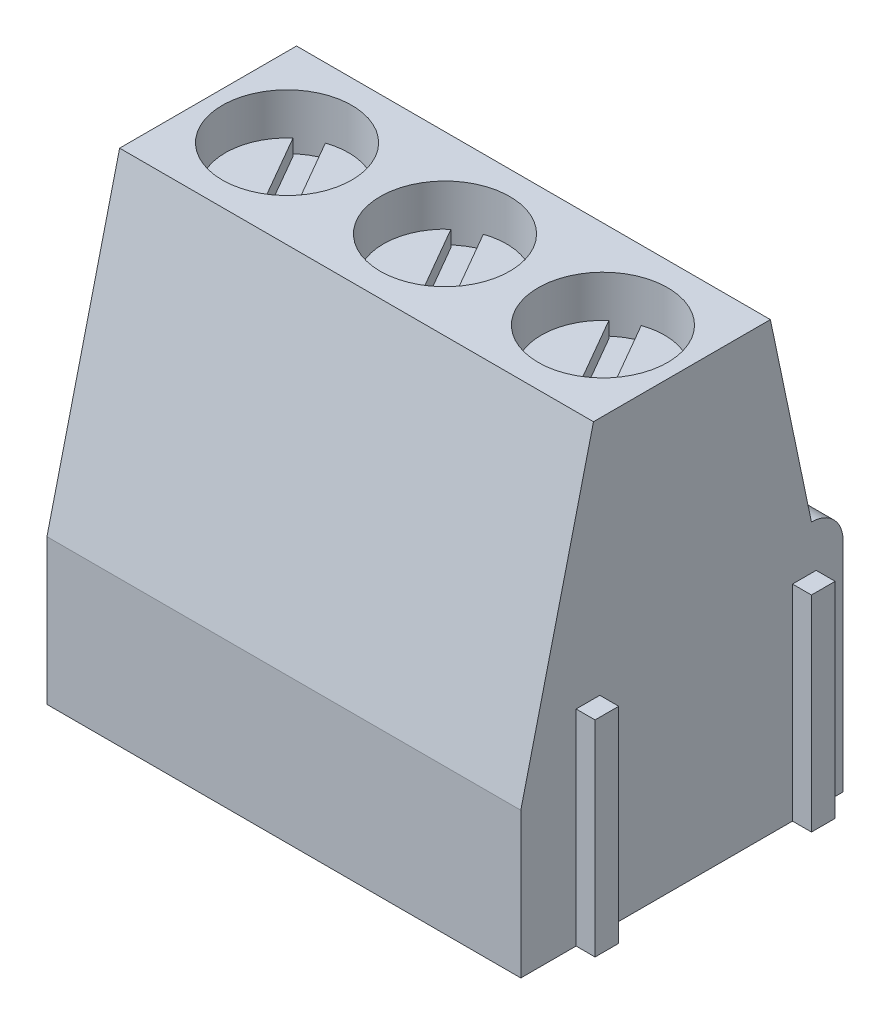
ISO-10303-21;
HEADER;
FILE_DESCRIPTION(('STEP AP214'),'2;1');
FILE_NAME('part.step','',(''),(''),'','','');
FILE_SCHEMA(('AUTOMOTIVE_DESIGN { 1 0 10303 214 1 1 1 1 }'));
ENDSEC;
DATA;
#1=APPLICATION_CONTEXT('core data for automotive mechanical design processes');
#2=APPLICATION_PROTOCOL_DEFINITION('international standard','automotive_design',2000,#1);
#3=PRODUCT_CONTEXT('',#1,'mechanical');
#4=PRODUCT('Part','Part','',(#3));
#5=PRODUCT_RELATED_PRODUCT_CATEGORY('part','',(#4));
#6=PRODUCT_DEFINITION_FORMATION('','',#4);
#7=PRODUCT_DEFINITION_CONTEXT('part definition',#1,'design');
#8=PRODUCT_DEFINITION('design','',#6,#7);
#9=PRODUCT_DEFINITION_SHAPE('','',#8);
#10=(LENGTH_UNIT() NAMED_UNIT(*) SI_UNIT(.MILLI.,.METRE.));
#11=(NAMED_UNIT(*) PLANE_ANGLE_UNIT() SI_UNIT($,.RADIAN.));
#12=(NAMED_UNIT(*) SI_UNIT($,.STERADIAN.) SOLID_ANGLE_UNIT());
#13=UNCERTAINTY_MEASURE_WITH_UNIT(LENGTH_MEASURE(1.E-05),#10,'distance_accuracy_value','');
#14=(GEOMETRIC_REPRESENTATION_CONTEXT(3) GLOBAL_UNCERTAINTY_ASSIGNED_CONTEXT((#13)) GLOBAL_UNIT_ASSIGNED_CONTEXT((#10,
#11,#12)) REPRESENTATION_CONTEXT('',''));
#15=CARTESIAN_POINT('',(0.,0.,0.));
#16=DIRECTION('',(0.,0.,1.));
#17=DIRECTION('',(1.,0.,0.));
#18=AXIS2_PLACEMENT_3D('',#15,#16,#17);
#19=CARTESIAN_POINT('',(5.,12.85,0.));
#20=DIRECTION('',(0.,1.,0.));
#21=DIRECTION('',(0.,0.,1.));
#22=AXIS2_PLACEMENT_3D('',#19,#20,#21);
#23=CYLINDRICAL_SURFACE('',#22,2.05);
#24=CARTESIAN_POINT('',(5.,14.1,0.));
#25=DIRECTION('',(0.,1.,0.));
#26=DIRECTION('',(0.,0.,1.));
#27=AXIS2_PLACEMENT_3D('',#24,#25,#26);
#28=CIRCLE('',#27,2.05);
#29=CARTESIAN_POINT('',(5.,14.1,2.05));
#30=VERTEX_POINT('',#29);
#31=EDGE_CURVE('E10',#30,#30,#28,.T.);
#32=ORIENTED_EDGE('',*,*,#31,.T.);
#33=EDGE_LOOP('',(#32));
#34=FACE_BOUND('',#33,.T.);
#35=CARTESIAN_POINT('',(5.,12.35,0.));
#36=DIRECTION('',(0.,1.,0.));
#37=DIRECTION('',(0.,0.,1.));
#38=AXIS2_PLACEMENT_3D('',#35,#36,#37);
#39=CIRCLE('',#38,2.05);
#40=CARTESIAN_POINT('',(5.,12.35,2.05));
#41=VERTEX_POINT('',#40);
#42=EDGE_CURVE('E540',#41,#41,#39,.T.);
#43=ORIENTED_EDGE('',*,*,#42,.F.);
#44=EDGE_LOOP('',(#43));
#45=FACE_BOUND('',#44,.T.);
#46=ADVANCED_FACE('F16',(#34,#45),#23,.F.);
#47=CARTESIAN_POINT('',(5.,12.35,0.));
#48=DIRECTION('',(0.,1.,0.));
#49=DIRECTION('',(0.,0.,1.));
#50=AXIS2_PLACEMENT_3D('',#47,#48,#49);
#51=CYLINDRICAL_SURFACE('',#50,1.95);
#52=CARTESIAN_POINT('',(5.,12.35,0.));
#53=DIRECTION('',(0.,1.,0.));
#54=DIRECTION('',(0.,0.,1.));
#55=AXIS2_PLACEMENT_3D('',#52,#53,#54);
#56=CIRCLE('',#55,1.95);
#57=CARTESIAN_POINT('',(3.71843916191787,12.35,-1.46972848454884));
#58=VERTEX_POINT('',#57);
#59=CARTESIAN_POINT('',(5.63204178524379,12.35,1.84472848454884));
#60=VERTEX_POINT('',#59);
#61=EDGE_CURVE('E26',#58,#60,#56,.T.);
#62=ORIENTED_EDGE('',*,*,#61,.T.);
#63=DIRECTION('',(0.,1.,0.));
#64=VECTOR('',#63,1.);
#65=CARTESIAN_POINT('',(5.63204178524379,12.35,1.84472848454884));
#66=LINE('',#65,#64);
#67=CARTESIAN_POINT('',(5.63204178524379,12.85,1.84472848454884));
#68=VERTEX_POINT('',#67);
#69=EDGE_CURVE('E546',#60,#68,#66,.T.);
#70=ORIENTED_EDGE('',*,*,#69,.T.);
#71=CARTESIAN_POINT('',(5.,12.85,0.));
#72=DIRECTION('',(0.,1.,0.));
#73=DIRECTION('',(0.,0.,1.));
#74=AXIS2_PLACEMENT_3D('',#71,#72,#73);
#75=CIRCLE('',#74,1.95);
#76=CARTESIAN_POINT('',(3.71843916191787,12.85,-1.46972848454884));
#77=VERTEX_POINT('',#76);
#78=EDGE_CURVE('E35',#77,#68,#75,.T.);
#79=ORIENTED_EDGE('',*,*,#78,.F.);
#80=DIRECTION('',(0.,1.,0.));
#81=VECTOR('',#80,1.);
#82=CARTESIAN_POINT('',(3.71843916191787,12.35,-1.46972848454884));
#83=LINE('',#82,#81);
#84=EDGE_CURVE('E545',#58,#77,#83,.T.);
#85=ORIENTED_EDGE('',*,*,#84,.F.);
#86=EDGE_LOOP('',(#62,#70,#79,#85));
#87=FACE_BOUND('',#86,.T.);
#88=ADVANCED_FACE('F814',(#87),#51,.T.);
#89=CARTESIAN_POINT('',(0.,12.35,0.));
#90=DIRECTION('',(0.,1.,0.));
#91=DIRECTION('',(0.,0.,1.));
#92=AXIS2_PLACEMENT_3D('',#89,#90,#91);
#93=CYLINDRICAL_SURFACE('',#92,1.95);
#94=CARTESIAN_POINT('',(0.,12.35,0.));
#95=DIRECTION('',(0.,1.,0.));
#96=DIRECTION('',(0.,0.,1.));
#97=AXIS2_PLACEMENT_3D('',#94,#95,#96);
#98=CIRCLE('',#97,1.95);
#99=CARTESIAN_POINT('',(-1.28156083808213,12.35,-1.46972848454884));
#100=VERTEX_POINT('',#99);
#101=CARTESIAN_POINT('',(0.632041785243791,12.35,1.84472848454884));
#102=VERTEX_POINT('',#101);
#103=EDGE_CURVE('E799',#100,#102,#98,.T.);
#104=ORIENTED_EDGE('',*,*,#103,.T.);
#105=DIRECTION('',(0.,1.,0.));
#106=VECTOR('',#105,1.);
#107=CARTESIAN_POINT('',(0.632041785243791,12.35,1.84472848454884));
#108=LINE('',#107,#106);
#109=CARTESIAN_POINT('',(0.632041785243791,12.85,1.84472848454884));
#110=VERTEX_POINT('',#109);
#111=EDGE_CURVE('E550',#102,#110,#108,.T.);
#112=ORIENTED_EDGE('',*,*,#111,.T.);
#113=CARTESIAN_POINT('',(0.,12.85,0.));
#114=DIRECTION('',(0.,1.,0.));
#115=DIRECTION('',(0.,0.,1.));
#116=AXIS2_PLACEMENT_3D('',#113,#114,#115);
#117=CIRCLE('',#116,1.95);
#118=CARTESIAN_POINT('',(-1.28156083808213,12.85,-1.46972848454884));
#119=VERTEX_POINT('',#118);
#120=EDGE_CURVE('E574',#119,#110,#117,.T.);
#121=ORIENTED_EDGE('',*,*,#120,.F.);
#122=DIRECTION('',(0.,1.,0.));
#123=VECTOR('',#122,1.);
#124=CARTESIAN_POINT('',(-1.28156083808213,12.35,-1.46972848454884));
#125=LINE('',#124,#123);
#126=EDGE_CURVE('E544',#100,#119,#125,.T.);
#127=ORIENTED_EDGE('',*,*,#126,.F.);
#128=EDGE_LOOP('',(#104,#112,#121,#127));
#129=FACE_BOUND('',#128,.T.);
#130=ADVANCED_FACE('F821',(#129),#93,.T.);
#131=CARTESIAN_POINT('',(0.,12.85,0.));
#132=DIRECTION('',(0.,1.,0.));
#133=DIRECTION('',(0.,0.,1.));
#134=AXIS2_PLACEMENT_3D('',#131,#132,#133);
#135=CYLINDRICAL_SURFACE('',#134,2.05);
#136=CARTESIAN_POINT('',(0.,14.1,0.));
#137=DIRECTION('',(0.,1.,0.));
#138=DIRECTION('',(0.,0.,1.));
#139=AXIS2_PLACEMENT_3D('',#136,#137,#138);
#140=CIRCLE('',#139,2.05);
#141=CARTESIAN_POINT('',(0.,14.1,2.05));
#142=VERTEX_POINT('',#141);
#143=EDGE_CURVE('E796',#142,#142,#140,.T.);
#144=ORIENTED_EDGE('',*,*,#143,.T.);
#145=EDGE_LOOP('',(#144));
#146=FACE_BOUND('',#145,.T.);
#147=CARTESIAN_POINT('',(0.,12.35,0.));
#148=DIRECTION('',(0.,1.,0.));
#149=DIRECTION('',(0.,0.,1.));
#150=AXIS2_PLACEMENT_3D('',#147,#148,#149);
#151=CIRCLE('',#150,2.05);
#152=CARTESIAN_POINT('',(0.,12.35,2.05));
#153=VERTEX_POINT('',#152);
#154=EDGE_CURVE('E553',#153,#153,#151,.T.);
#155=ORIENTED_EDGE('',*,*,#154,.F.);
#156=EDGE_LOOP('',(#155));
#157=FACE_BOUND('',#156,.T.);
#158=ADVANCED_FACE('F826',(#146,#157),#135,.F.);
#159=CARTESIAN_POINT('',(-5.,12.35,0.));
#160=DIRECTION('',(0.,1.,0.));
#161=DIRECTION('',(0.,0.,1.));
#162=AXIS2_PLACEMENT_3D('',#159,#160,#161);
#163=CYLINDRICAL_SURFACE('',#162,1.95);
#164=CARTESIAN_POINT('',(-5.,12.35,0.));
#165=DIRECTION('',(0.,1.,0.));
#166=DIRECTION('',(0.,0.,1.));
#167=AXIS2_PLACEMENT_3D('',#164,#165,#166);
#168=CIRCLE('',#167,1.95);
#169=CARTESIAN_POINT('',(-6.28156083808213,12.35,-1.46972848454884));
#170=VERTEX_POINT('',#169);
#171=CARTESIAN_POINT('',(-4.36795821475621,12.35,1.84472848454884));
#172=VERTEX_POINT('',#171);
#173=EDGE_CURVE('E789',#170,#172,#168,.T.);
#174=ORIENTED_EDGE('',*,*,#173,.T.);
#175=DIRECTION('',(0.,1.,0.));
#176=VECTOR('',#175,1.);
#177=CARTESIAN_POINT('',(-4.36795821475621,12.35,1.84472848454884));
#178=LINE('',#177,#176);
#179=CARTESIAN_POINT('',(-4.36795821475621,12.85,1.84472848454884));
#180=VERTEX_POINT('',#179);
#181=EDGE_CURVE('E631',#172,#180,#178,.T.);
#182=ORIENTED_EDGE('',*,*,#181,.T.);
#183=CARTESIAN_POINT('',(-5.,12.85,0.));
#184=DIRECTION('',(0.,1.,0.));
#185=DIRECTION('',(0.,0.,1.));
#186=AXIS2_PLACEMENT_3D('',#183,#184,#185);
#187=CIRCLE('',#186,1.95);
#188=CARTESIAN_POINT('',(-6.28156083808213,12.85,-1.46972848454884));
#189=VERTEX_POINT('',#188);
#190=EDGE_CURVE('E630',#189,#180,#187,.T.);
#191=ORIENTED_EDGE('',*,*,#190,.F.);
#192=DIRECTION('',(0.,1.,0.));
#193=VECTOR('',#192,1.);
#194=CARTESIAN_POINT('',(-6.28156083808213,12.35,-1.46972848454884));
#195=LINE('',#194,#193);
#196=EDGE_CURVE('E639',#170,#189,#195,.T.);
#197=ORIENTED_EDGE('',*,*,#196,.F.);
#198=EDGE_LOOP('',(#174,#182,#191,#197));
#199=FACE_BOUND('',#198,.T.);
#200=ADVANCED_FACE('F830',(#199),#163,.T.);
#201=CARTESIAN_POINT('',(-5.,12.85,0.));
#202=DIRECTION('',(0.,1.,0.));
#203=DIRECTION('',(0.,0.,1.));
#204=AXIS2_PLACEMENT_3D('',#201,#202,#203);
#205=CYLINDRICAL_SURFACE('',#204,2.05);
#206=CARTESIAN_POINT('',(-5.,14.1,0.));
#207=DIRECTION('',(0.,1.,0.));
#208=DIRECTION('',(0.,0.,1.));
#209=AXIS2_PLACEMENT_3D('',#206,#207,#208);
#210=CIRCLE('',#209,2.05);
#211=CARTESIAN_POINT('',(-5.,14.1,2.05));
#212=VERTEX_POINT('',#211);
#213=EDGE_CURVE('E784',#212,#212,#210,.T.);
#214=ORIENTED_EDGE('',*,*,#213,.T.);
#215=EDGE_LOOP('',(#214));
#216=FACE_BOUND('',#215,.T.);
#217=CARTESIAN_POINT('',(-5.,12.35,0.));
#218=DIRECTION('',(0.,1.,0.));
#219=DIRECTION('',(0.,0.,1.));
#220=AXIS2_PLACEMENT_3D('',#217,#218,#219);
#221=CIRCLE('',#220,2.05);
#222=CARTESIAN_POINT('',(-5.,12.35,2.05));
#223=VERTEX_POINT('',#222);
#224=EDGE_CURVE('E650',#223,#223,#221,.T.);
#225=ORIENTED_EDGE('',*,*,#224,.F.);
#226=EDGE_LOOP('',(#225));
#227=FACE_BOUND('',#226,.T.);
#228=ADVANCED_FACE('F834',(#216,#227),#205,.F.);
#229=CARTESIAN_POINT('',(7.5,14.1,5.1));
#230=DIRECTION('',(-1.,0.,0.));
#231=DIRECTION('',(0.,0.,1.));
#232=AXIS2_PLACEMENT_3D('',#229,#230,#231);
#233=PLANE('',#232);
#234=DIRECTION('',(0.,1.,0.));
#235=VECTOR('',#234,1.);
#236=CARTESIAN_POINT('',(7.5,0.,2.6));
#237=LINE('',#236,#235);
#238=CARTESIAN_POINT('',(7.5,0.,2.6));
#239=VERTEX_POINT('',#238);
#240=CARTESIAN_POINT('',(7.5,6.5,2.6));
#241=VERTEX_POINT('',#240);
#242=EDGE_CURVE('E414',#239,#241,#237,.T.);
#243=ORIENTED_EDGE('',*,*,#242,.F.);
#244=DIRECTION('',(0.,0.,-1.));
#245=VECTOR('',#244,1.);
#246=CARTESIAN_POINT('',(7.5,0.,5.1));
#247=LINE('',#246,#245);
#248=CARTESIAN_POINT('',(7.5,0.,-3.5));
#249=VERTEX_POINT('',#248);
#250=EDGE_CURVE('E777',#239,#249,#247,.T.);
#251=ORIENTED_EDGE('',*,*,#250,.T.);
#252=DIRECTION('',(0.,-1.,0.));
#253=VECTOR('',#252,1.);
#254=CARTESIAN_POINT('',(7.5,6.5,-3.5));
#255=LINE('',#254,#253);
#256=CARTESIAN_POINT('',(7.5,6.5,-3.5));
#257=VERTEX_POINT('',#256);
#258=EDGE_CURVE('E425',#257,#249,#255,.T.);
#259=ORIENTED_EDGE('',*,*,#258,.F.);
#260=DIRECTION('',(0.,0.,1.));
#261=VECTOR('',#260,1.);
#262=CARTESIAN_POINT('',(7.5,6.5,-4.25));
#263=LINE('',#262,#261);
#264=CARTESIAN_POINT('',(7.5,6.5,-4.25));
#265=VERTEX_POINT('',#264);
#266=EDGE_CURVE('E420',#265,#257,#263,.T.);
#267=ORIENTED_EDGE('',*,*,#266,.F.);
#268=DIRECTION('',(0.,1.,0.));
#269=VECTOR('',#268,1.);
#270=CARTESIAN_POINT('',(7.5,0.,-4.25));
#271=LINE('',#270,#269);
#272=CARTESIAN_POINT('',(7.5,0.,-4.25));
#273=VERTEX_POINT('',#272);
#274=EDGE_CURVE('E426',#273,#265,#271,.T.);
#275=ORIENTED_EDGE('',*,*,#274,.F.);
#276=DIRECTION('',(0.,0.,-1.));
#277=VECTOR('',#276,1.);
#278=CARTESIAN_POINT('',(7.5,0.,5.1));
#279=LINE('',#278,#277);
#280=CARTESIAN_POINT('',(7.5,0.,-5.1));
#281=VERTEX_POINT('',#280);
#282=EDGE_CURVE('E773',#273,#281,#279,.T.);
#283=ORIENTED_EDGE('',*,*,#282,.T.);
#284=DIRECTION('',(0.,-1.,0.));
#285=VECTOR('',#284,1.);
#286=CARTESIAN_POINT('',(7.5,14.1,-5.1));
#287=LINE('',#286,#285);
#288=CARTESIAN_POINT('',(7.5,6.9,-5.1));
#289=VERTEX_POINT('',#288);
#290=EDGE_CURVE('E695',#289,#281,#287,.T.);
#291=ORIENTED_EDGE('',*,*,#290,.F.);
#292=CARTESIAN_POINT('',(7.5,6.9,-4.1));
#293=DIRECTION('',(1.,0.,0.));
#294=DIRECTION('',(0.,0.,1.));
#295=AXIS2_PLACEMENT_3D('',#292,#293,#294);
#296=CIRCLE('',#295,1.);
#297=CARTESIAN_POINT('',(7.5,7.9,-4.1));
#298=VERTEX_POINT('',#297);
#299=EDGE_CURVE('E766',#289,#298,#296,.T.);
#300=ORIENTED_EDGE('',*,*,#299,.T.);
#301=DIRECTION('',(0.,-0.978716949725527,-0.205214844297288));
#302=VECTOR('',#301,1.);
#303=CARTESIAN_POINT('',(7.5,7.9,-4.1));
#304=LINE('',#303,#302);
#305=CARTESIAN_POINT('',(7.5,14.1,-2.8));
#306=VERTEX_POINT('',#305);
#307=EDGE_CURVE('E691',#306,#298,#304,.T.);
#308=ORIENTED_EDGE('',*,*,#307,.F.);
#309=DIRECTION('',(0.,0.,-1.));
#310=VECTOR('',#309,1.);
#311=CARTESIAN_POINT('',(7.5,14.1,5.1));
#312=LINE('',#311,#310);
#313=CARTESIAN_POINT('',(7.5,14.1,2.8));
#314=VERTEX_POINT('',#313);
#315=EDGE_CURVE('E696',#314,#306,#312,.T.);
#316=ORIENTED_EDGE('',*,*,#315,.F.);
#317=DIRECTION('',(0.,0.971921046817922,-0.23530720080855));
#318=VECTOR('',#317,1.);
#319=CARTESIAN_POINT('',(7.5,4.6,5.1));
#320=LINE('',#319,#318);
#321=CARTESIAN_POINT('',(7.5,4.6,5.1));
#322=VERTEX_POINT('',#321);
#323=EDGE_CURVE('E662',#322,#314,#320,.T.);
#324=ORIENTED_EDGE('',*,*,#323,.F.);
#325=DIRECTION('',(0.,-1.,0.));
#326=VECTOR('',#325,1.);
#327=CARTESIAN_POINT('',(7.5,14.1,5.1));
#328=LINE('',#327,#326);
#329=CARTESIAN_POINT('',(7.5,0.,5.1));
#330=VERTEX_POINT('',#329);
#331=EDGE_CURVE('E763',#322,#330,#328,.T.);
#332=ORIENTED_EDGE('',*,*,#331,.T.);
#333=DIRECTION('',(0.,0.,-1.));
#334=VECTOR('',#333,1.);
#335=CARTESIAN_POINT('',(7.5,0.,5.1));
#336=LINE('',#335,#334);
#337=CARTESIAN_POINT('',(7.5,0.,3.35));
#338=VERTEX_POINT('',#337);
#339=EDGE_CURVE('E754',#330,#338,#336,.T.);
#340=ORIENTED_EDGE('',*,*,#339,.T.);
#341=DIRECTION('',(0.,-1.,0.));
#342=VECTOR('',#341,1.);
#343=CARTESIAN_POINT('',(7.5,6.5,3.35));
#344=LINE('',#343,#342);
#345=CARTESIAN_POINT('',(7.5,6.5,3.35));
#346=VERTEX_POINT('',#345);
#347=EDGE_CURVE('E403',#346,#338,#344,.T.);
#348=ORIENTED_EDGE('',*,*,#347,.F.);
#349=DIRECTION('',(0.,0.,1.));
#350=VECTOR('',#349,1.);
#351=CARTESIAN_POINT('',(7.5,6.5,2.6));
#352=LINE('',#351,#350);
#353=EDGE_CURVE('E409',#241,#346,#352,.T.);
#354=ORIENTED_EDGE('',*,*,#353,.F.);
#355=EDGE_LOOP('',(#243,#251,#259,#267,#275,#283,#291,#300,#308,#316,#324,#332,#340,#348,#354));
#356=FACE_BOUND('',#355,.T.);
#357=ADVANCED_FACE('F838',(#356),#233,.F.);
#358=CARTESIAN_POINT('',(-7.5,14.1,5.1));
#359=DIRECTION('',(1.,0.,0.));
#360=DIRECTION('',(0.,0.,-1.));
#361=AXIS2_PLACEMENT_3D('',#358,#359,#360);
#362=PLANE('',#361);
#363=DIRECTION('',(0.,0.,-1.));
#364=VECTOR('',#363,1.);
#365=CARTESIAN_POINT('',(-7.5,6.5,3.35));
#366=LINE('',#365,#364);
#367=CARTESIAN_POINT('',(-7.5,6.5,3.35));
#368=VERTEX_POINT('',#367);
#369=CARTESIAN_POINT('',(-7.5,6.5,2.6));
#370=VERTEX_POINT('',#369);
#371=EDGE_CURVE('E367',#368,#370,#366,.T.);
#372=ORIENTED_EDGE('',*,*,#371,.F.);
#373=DIRECTION('',(0.,1.,0.));
#374=VECTOR('',#373,1.);
#375=CARTESIAN_POINT('',(-7.5,0.,3.35));
#376=LINE('',#375,#374);
#377=CARTESIAN_POINT('',(-7.5,0.,3.35));
#378=VERTEX_POINT('',#377);
#379=EDGE_CURVE('E393',#378,#368,#376,.T.);
#380=ORIENTED_EDGE('',*,*,#379,.F.);
#381=DIRECTION('',(0.,0.,1.));
#382=VECTOR('',#381,1.);
#383=CARTESIAN_POINT('',(-7.5,0.,5.1));
#384=LINE('',#383,#382);
#385=CARTESIAN_POINT('',(-7.5,0.,5.1));
#386=VERTEX_POINT('',#385);
#387=EDGE_CURVE('E750',#378,#386,#384,.T.);
#388=ORIENTED_EDGE('',*,*,#387,.T.);
#389=DIRECTION('',(0.,-1.,0.));
#390=VECTOR('',#389,1.);
#391=CARTESIAN_POINT('',(-7.5,14.1,5.1));
#392=LINE('',#391,#390);
#393=CARTESIAN_POINT('',(-7.5,4.6,5.1));
#394=VERTEX_POINT('',#393);
#395=EDGE_CURVE('E723',#394,#386,#392,.T.);
#396=ORIENTED_EDGE('',*,*,#395,.F.);
#397=DIRECTION('',(0.,0.971921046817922,-0.23530720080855));
#398=VECTOR('',#397,1.);
#399=CARTESIAN_POINT('',(-7.5,4.6,5.1));
#400=LINE('',#399,#398);
#401=CARTESIAN_POINT('',(-7.5,14.1,2.8));
#402=VERTEX_POINT('',#401);
#403=EDGE_CURVE('E746',#394,#402,#400,.T.);
#404=ORIENTED_EDGE('',*,*,#403,.T.);
#405=DIRECTION('',(0.,0.,1.));
#406=VECTOR('',#405,1.);
#407=CARTESIAN_POINT('',(-7.5,14.1,5.1));
#408=LINE('',#407,#406);
#409=CARTESIAN_POINT('',(-7.5,14.1,-2.8));
#410=VERTEX_POINT('',#409);
#411=EDGE_CURVE('E688',#410,#402,#408,.T.);
#412=ORIENTED_EDGE('',*,*,#411,.F.);
#413=DIRECTION('',(0.,-0.978716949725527,-0.205214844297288));
#414=VECTOR('',#413,1.);
#415=CARTESIAN_POINT('',(-7.5,7.9,-4.1));
#416=LINE('',#415,#414);
#417=CARTESIAN_POINT('',(-7.5,7.9,-4.1));
#418=VERTEX_POINT('',#417);
#419=EDGE_CURVE('E743',#410,#418,#416,.T.);
#420=ORIENTED_EDGE('',*,*,#419,.T.);
#421=CARTESIAN_POINT('',(-7.5,6.9,-4.1));
#422=DIRECTION('',(-1.,0.,0.));
#423=DIRECTION('',(0.,0.,-1.));
#424=AXIS2_PLACEMENT_3D('',#421,#422,#423);
#425=CIRCLE('',#424,1.);
#426=CARTESIAN_POINT('',(-7.5,6.9,-5.1));
#427=VERTEX_POINT('',#426);
#428=EDGE_CURVE('E740',#418,#427,#425,.T.);
#429=ORIENTED_EDGE('',*,*,#428,.T.);
#430=DIRECTION('',(0.,-1.,0.));
#431=VECTOR('',#430,1.);
#432=CARTESIAN_POINT('',(-7.5,14.1,-5.1));
#433=LINE('',#432,#431);
#434=CARTESIAN_POINT('',(-7.5,0.,-5.1));
#435=VERTEX_POINT('',#434);
#436=EDGE_CURVE('E737',#427,#435,#433,.T.);
#437=ORIENTED_EDGE('',*,*,#436,.T.);
#438=DIRECTION('',(0.,0.,1.));
#439=VECTOR('',#438,1.);
#440=CARTESIAN_POINT('',(-7.5,0.,5.1));
#441=LINE('',#440,#439);
#442=CARTESIAN_POINT('',(-7.5,0.,-4.25));
#443=VERTEX_POINT('',#442);
#444=EDGE_CURVE('E731',#435,#443,#441,.T.);
#445=ORIENTED_EDGE('',*,*,#444,.T.);
#446=DIRECTION('',(0.,-1.,0.));
#447=VECTOR('',#446,1.);
#448=CARTESIAN_POINT('',(-7.5,6.5,-4.25));
#449=LINE('',#448,#447);
#450=CARTESIAN_POINT('',(-7.5,6.5,-4.25));
#451=VERTEX_POINT('',#450);
#452=EDGE_CURVE('E390',#451,#443,#449,.T.);
#453=ORIENTED_EDGE('',*,*,#452,.F.);
#454=DIRECTION('',(0.,0.,-1.));
#455=VECTOR('',#454,1.);
#456=CARTESIAN_POINT('',(-7.5,6.5,-3.5));
#457=LINE('',#456,#455);
#458=CARTESIAN_POINT('',(-7.5,6.5,-3.5));
#459=VERTEX_POINT('',#458);
#460=EDGE_CURVE('E382',#459,#451,#457,.T.);
#461=ORIENTED_EDGE('',*,*,#460,.F.);
#462=DIRECTION('',(0.,1.,0.));
#463=VECTOR('',#462,1.);
#464=CARTESIAN_POINT('',(-7.5,0.,-3.5));
#465=LINE('',#464,#463);
#466=CARTESIAN_POINT('',(-7.5,0.,-3.5));
#467=VERTEX_POINT('',#466);
#468=EDGE_CURVE('E383',#467,#459,#465,.T.);
#469=ORIENTED_EDGE('',*,*,#468,.F.);
#470=DIRECTION('',(0.,0.,1.));
#471=VECTOR('',#470,1.);
#472=CARTESIAN_POINT('',(-7.5,0.,5.1));
#473=LINE('',#472,#471);
#474=CARTESIAN_POINT('',(-7.5,0.,2.6));
#475=VERTEX_POINT('',#474);
#476=EDGE_CURVE('E728',#467,#475,#473,.T.);
#477=ORIENTED_EDGE('',*,*,#476,.T.);
#478=DIRECTION('',(0.,-1.,0.));
#479=VECTOR('',#478,1.);
#480=CARTESIAN_POINT('',(-7.5,6.5,2.6));
#481=LINE('',#480,#479);
#482=EDGE_CURVE('E369',#370,#475,#481,.T.);
#483=ORIENTED_EDGE('',*,*,#482,.F.);
#484=EDGE_LOOP('',(#372,#380,#388,#396,#404,#412,#420,#429,#437,#445,#453,#461,#469,#477,#483));
#485=FACE_BOUND('',#484,.T.);
#486=ADVANCED_FACE('F842',(#485),#362,.F.);
#487=CARTESIAN_POINT('',(-7.5,14.1,5.1));
#488=DIRECTION('',(0.,0.,-1.));
#489=DIRECTION('',(-1.,0.,0.));
#490=AXIS2_PLACEMENT_3D('',#487,#488,#489);
#491=PLANE('',#490);
#492=ORIENTED_EDGE('',*,*,#331,.F.);
#493=DIRECTION('',(1.,0.,0.));
#494=VECTOR('',#493,1.);
#495=CARTESIAN_POINT('',(-7.5,4.6,5.1));
#496=LINE('',#495,#494);
#497=EDGE_CURVE('E724',#394,#322,#496,.T.);
#498=ORIENTED_EDGE('',*,*,#497,.F.);
#499=ORIENTED_EDGE('',*,*,#395,.T.);
#500=DIRECTION('',(1.,0.,0.));
#501=VECTOR('',#500,1.);
#502=CARTESIAN_POINT('',(-7.5,0.,5.1));
#503=LINE('',#502,#501);
#504=EDGE_CURVE('E700',#386,#330,#503,.T.);
#505=ORIENTED_EDGE('',*,*,#504,.T.);
#506=EDGE_LOOP('',(#492,#498,#499,#505));
#507=FACE_BOUND('',#506,.T.);
#508=ADVANCED_FACE('F846',(#507),#491,.F.);
#509=CARTESIAN_POINT('',(-7.5,14.1,-5.1));
#510=DIRECTION('',(0.,0.,1.));
#511=DIRECTION('',(1.,0.,0.));
#512=AXIS2_PLACEMENT_3D('',#509,#510,#511);
#513=PLANE('',#512);
#514=DIRECTION('',(1.,0.,0.));
#515=VECTOR('',#514,1.);
#516=CARTESIAN_POINT('',(3.3,6.5,-5.1));
#517=LINE('',#516,#515);
#518=CARTESIAN_POINT('',(3.3,6.5,-5.1));
#519=VERTEX_POINT('',#518);
#520=CARTESIAN_POINT('',(6.7,6.5,-5.1));
#521=VERTEX_POINT('',#520);
#522=EDGE_CURVE('E493',#519,#521,#517,.T.);
#523=ORIENTED_EDGE('',*,*,#522,.F.);
#524=DIRECTION('',(0.,1.,0.));
#525=VECTOR('',#524,1.);
#526=CARTESIAN_POINT('',(3.3,6.5,-5.1));
#527=LINE('',#526,#525);
#528=CARTESIAN_POINT('',(3.3,1.6,-5.1));
#529=VERTEX_POINT('',#528);
#530=EDGE_CURVE('E709',#529,#519,#527,.T.);
#531=ORIENTED_EDGE('',*,*,#530,.F.);
#532=DIRECTION('',(-1.,0.,0.));
#533=VECTOR('',#532,1.);
#534=CARTESIAN_POINT('',(3.3,1.6,-5.1));
#535=LINE('',#534,#533);
#536=CARTESIAN_POINT('',(6.7,1.6,-5.1));
#537=VERTEX_POINT('',#536);
#538=EDGE_CURVE('E506',#537,#529,#535,.T.);
#539=ORIENTED_EDGE('',*,*,#538,.F.);
#540=DIRECTION('',(0.,-1.,0.));
#541=VECTOR('',#540,1.);
#542=CARTESIAN_POINT('',(6.7,1.6,-5.1));
#543=LINE('',#542,#541);
#544=EDGE_CURVE('E488',#521,#537,#543,.T.);
#545=ORIENTED_EDGE('',*,*,#544,.F.);
#546=EDGE_LOOP('',(#523,#531,#539,#545));
#547=FACE_BOUND('',#546,.T.);
#548=DIRECTION('',(1.,0.,0.));
#549=VECTOR('',#548,1.);
#550=CARTESIAN_POINT('',(-1.7,6.5,-5.1));
#551=LINE('',#550,#549);
#552=CARTESIAN_POINT('',(-1.7,6.5,-5.1));
#553=VERTEX_POINT('',#552);
#554=CARTESIAN_POINT('',(1.7,6.5,-5.1));
#555=VERTEX_POINT('',#554);
#556=EDGE_CURVE('E510',#553,#555,#551,.T.);
#557=ORIENTED_EDGE('',*,*,#556,.F.);
#558=DIRECTION('',(0.,1.,0.));
#559=VECTOR('',#558,1.);
#560=CARTESIAN_POINT('',(-1.7,6.5,-5.1));
#561=LINE('',#560,#559);
#562=CARTESIAN_POINT('',(-1.7,1.6,-5.1));
#563=VERTEX_POINT('',#562);
#564=EDGE_CURVE('E494',#563,#553,#561,.T.);
#565=ORIENTED_EDGE('',*,*,#564,.F.);
#566=DIRECTION('',(-1.,0.,0.));
#567=VECTOR('',#566,1.);
#568=CARTESIAN_POINT('',(-1.7,1.6,-5.1));
#569=LINE('',#568,#567);
#570=CARTESIAN_POINT('',(1.7,1.6,-5.1));
#571=VERTEX_POINT('',#570);
#572=EDGE_CURVE('E522',#571,#563,#569,.T.);
#573=ORIENTED_EDGE('',*,*,#572,.F.);
#574=DIRECTION('',(0.,-1.,0.));
#575=VECTOR('',#574,1.);
#576=CARTESIAN_POINT('',(1.7,1.6,-5.1));
#577=LINE('',#576,#575);
#578=EDGE_CURVE('E707',#555,#571,#577,.T.);
#579=ORIENTED_EDGE('',*,*,#578,.F.);
#580=EDGE_LOOP('',(#557,#565,#573,#579));
#581=FACE_BOUND('',#580,.T.);
#582=DIRECTION('',(1.,0.,0.));
#583=VECTOR('',#582,1.);
#584=CARTESIAN_POINT('',(-6.7,6.5,-5.1));
#585=LINE('',#584,#583);
#586=CARTESIAN_POINT('',(-6.7,6.5,-5.1));
#587=VERTEX_POINT('',#586);
#588=CARTESIAN_POINT('',(-3.3,6.5,-5.1));
#589=VERTEX_POINT('',#588);
#590=EDGE_CURVE('E612',#587,#589,#585,.T.);
#591=ORIENTED_EDGE('',*,*,#590,.F.);
#592=DIRECTION('',(0.,1.,0.));
#593=VECTOR('',#592,1.);
#594=CARTESIAN_POINT('',(-6.7,6.5,-5.1));
#595=LINE('',#594,#593);
#596=CARTESIAN_POINT('',(-6.7,1.6,-5.1));
#597=VERTEX_POINT('',#596);
#598=EDGE_CURVE('E613',#597,#587,#595,.T.);
#599=ORIENTED_EDGE('',*,*,#598,.F.);
#600=DIRECTION('',(-1.,0.,0.));
#601=VECTOR('',#600,1.);
#602=CARTESIAN_POINT('',(-6.7,1.6,-5.1));
#603=LINE('',#602,#601);
#604=CARTESIAN_POINT('',(-3.3,1.6,-5.1));
#605=VERTEX_POINT('',#604);
#606=EDGE_CURVE('E625',#605,#597,#603,.T.);
#607=ORIENTED_EDGE('',*,*,#606,.F.);
#608=DIRECTION('',(0.,-1.,0.));
#609=VECTOR('',#608,1.);
#610=CARTESIAN_POINT('',(-3.3,1.6,-5.1));
#611=LINE('',#610,#609);
#612=EDGE_CURVE('E607',#589,#605,#611,.T.);
#613=ORIENTED_EDGE('',*,*,#612,.F.);
#614=EDGE_LOOP('',(#591,#599,#607,#613));
#615=FACE_BOUND('',#614,.T.);
#616=ORIENTED_EDGE('',*,*,#436,.F.);
#617=DIRECTION('',(1.,0.,0.));
#618=VECTOR('',#617,1.);
#619=CARTESIAN_POINT('',(-7.5,6.9,-5.1));
#620=LINE('',#619,#618);
#621=EDGE_CURVE('E697',#427,#289,#620,.T.);
#622=ORIENTED_EDGE('',*,*,#621,.T.);
#623=ORIENTED_EDGE('',*,*,#290,.T.);
#624=DIRECTION('',(-1.,0.,0.));
#625=VECTOR('',#624,1.);
#626=CARTESIAN_POINT('',(-7.5,0.,-5.1));
#627=LINE('',#626,#625);
#628=EDGE_CURVE('E692',#281,#435,#627,.T.);
#629=ORIENTED_EDGE('',*,*,#628,.T.);
#630=EDGE_LOOP('',(#616,#622,#623,#629));
#631=FACE_BOUND('',#630,.T.);
#632=ADVANCED_FACE('F850',(#547,#581,#615,#631),#513,.F.);
#633=CARTESIAN_POINT('',(-7.5,14.1,-5.1));
#634=DIRECTION('',(0.,-1.,0.));
#635=DIRECTION('',(0.,0.,-1.));
#636=AXIS2_PLACEMENT_3D('',#633,#634,#635);
#637=PLANE('',#636);
#638=ORIENTED_EDGE('',*,*,#143,.F.);
#639=EDGE_LOOP('',(#638));
#640=FACE_BOUND('',#639,.T.);
#641=ORIENTED_EDGE('',*,*,#213,.F.);
#642=EDGE_LOOP('',(#641));
#643=FACE_BOUND('',#642,.T.);
#644=ORIENTED_EDGE('',*,*,#315,.T.);
#645=DIRECTION('',(1.,0.,0.));
#646=VECTOR('',#645,1.);
#647=CARTESIAN_POINT('',(-7.5,14.1,-2.8));
#648=LINE('',#647,#646);
#649=EDGE_CURVE('E657',#410,#306,#648,.T.);
#650=ORIENTED_EDGE('',*,*,#649,.F.);
#651=ORIENTED_EDGE('',*,*,#411,.T.);
#652=DIRECTION('',(1.,0.,0.));
#653=VECTOR('',#652,1.);
#654=CARTESIAN_POINT('',(-7.5,14.1,2.8));
#655=LINE('',#654,#653);
#656=EDGE_CURVE('E681',#402,#314,#655,.T.);
#657=ORIENTED_EDGE('',*,*,#656,.T.);
#658=EDGE_LOOP('',(#644,#650,#651,#657));
#659=FACE_BOUND('',#658,.T.);
#660=ORIENTED_EDGE('',*,*,#31,.F.);
#661=EDGE_LOOP('',(#660));
#662=FACE_BOUND('',#661,.T.);
#663=ADVANCED_FACE('F854',(#640,#643,#659,#662),#637,.F.);
#664=CARTESIAN_POINT('',(-7.5,0.,-5.1));
#665=DIRECTION('',(0.,-1.,0.));
#666=DIRECTION('',(0.,0.,-1.));
#667=AXIS2_PLACEMENT_3D('',#664,#665,#666);
#668=PLANE('',#667);
#669=DIRECTION('',(-1.,0.,0.));
#670=VECTOR('',#669,1.);
#671=CARTESIAN_POINT('',(-6.9,0.,3.35));
#672=LINE('',#671,#670);
#673=CARTESIAN_POINT('',(-6.9,0.,3.35));
#674=VERTEX_POINT('',#673);
#675=EDGE_CURVE('E683',#674,#378,#672,.T.);
#676=ORIENTED_EDGE('',*,*,#675,.F.);
#677=DIRECTION('',(0.,0.,1.));
#678=VECTOR('',#677,1.);
#679=CARTESIAN_POINT('',(-6.9,0.,2.6));
#680=LINE('',#679,#678);
#681=CARTESIAN_POINT('',(-6.9,0.,2.6));
#682=VERTEX_POINT('',#681);
#683=EDGE_CURVE('E361',#682,#674,#680,.T.);
#684=ORIENTED_EDGE('',*,*,#683,.F.);
#685=DIRECTION('',(-1.,0.,0.));
#686=VECTOR('',#685,1.);
#687=CARTESIAN_POINT('',(-6.9,0.,2.6));
#688=LINE('',#687,#686);
#689=EDGE_CURVE('E360',#682,#475,#688,.T.);
#690=ORIENTED_EDGE('',*,*,#689,.T.);
#691=ORIENTED_EDGE('',*,*,#476,.F.);
#692=DIRECTION('',(-1.,0.,0.));
#693=VECTOR('',#692,1.);
#694=CARTESIAN_POINT('',(-6.9,0.,-3.5));
#695=LINE('',#694,#693);
#696=CARTESIAN_POINT('',(-6.9,0.,-3.5));
#697=VERTEX_POINT('',#696);
#698=EDGE_CURVE('E677',#697,#467,#695,.T.);
#699=ORIENTED_EDGE('',*,*,#698,.F.);
#700=DIRECTION('',(0.,0.,1.));
#701=VECTOR('',#700,1.);
#702=CARTESIAN_POINT('',(-6.9,0.,-4.25));
#703=LINE('',#702,#701);
#704=CARTESIAN_POINT('',(-6.9,0.,-4.25));
#705=VERTEX_POINT('',#704);
#706=EDGE_CURVE('E377',#705,#697,#703,.T.);
#707=ORIENTED_EDGE('',*,*,#706,.F.);
#708=DIRECTION('',(-1.,0.,0.));
#709=VECTOR('',#708,1.);
#710=CARTESIAN_POINT('',(-6.9,0.,-4.25));
#711=LINE('',#710,#709);
#712=EDGE_CURVE('E669',#705,#443,#711,.T.);
#713=ORIENTED_EDGE('',*,*,#712,.T.);
#714=ORIENTED_EDGE('',*,*,#444,.F.);
#715=ORIENTED_EDGE('',*,*,#628,.F.);
#716=ORIENTED_EDGE('',*,*,#282,.F.);
#717=DIRECTION('',(-1.,0.,0.));
#718=VECTOR('',#717,1.);
#719=CARTESIAN_POINT('',(8.1,0.,-4.25));
#720=LINE('',#719,#718);
#721=CARTESIAN_POINT('',(8.1,0.,-4.25));
#722=VERTEX_POINT('',#721);
#723=EDGE_CURVE('E671',#722,#273,#720,.T.);
#724=ORIENTED_EDGE('',*,*,#723,.F.);
#725=DIRECTION('',(0.,0.,-1.));
#726=VECTOR('',#725,1.);
#727=CARTESIAN_POINT('',(8.1,0.,-4.25));
#728=LINE('',#727,#726);
#729=CARTESIAN_POINT('',(8.1,0.,-3.5));
#730=VERTEX_POINT('',#729);
#731=EDGE_CURVE('E416',#730,#722,#728,.T.);
#732=ORIENTED_EDGE('',*,*,#731,.F.);
#733=DIRECTION('',(-1.,0.,0.));
#734=VECTOR('',#733,1.);
#735=CARTESIAN_POINT('',(8.1,0.,-3.5));
#736=LINE('',#735,#734);
#737=EDGE_CURVE('E661',#730,#249,#736,.T.);
#738=ORIENTED_EDGE('',*,*,#737,.T.);
#739=ORIENTED_EDGE('',*,*,#250,.F.);
#740=DIRECTION('',(-1.,0.,0.));
#741=VECTOR('',#740,1.);
#742=CARTESIAN_POINT('',(8.1,0.,2.6));
#743=LINE('',#742,#741);
#744=CARTESIAN_POINT('',(8.1,0.,2.6));
#745=VERTEX_POINT('',#744);
#746=EDGE_CURVE('E664',#745,#239,#743,.T.);
#747=ORIENTED_EDGE('',*,*,#746,.F.);
#748=DIRECTION('',(0.,0.,-1.));
#749=VECTOR('',#748,1.);
#750=CARTESIAN_POINT('',(8.1,0.,3.35));
#751=LINE('',#750,#749);
#752=CARTESIAN_POINT('',(8.1,0.,3.35));
#753=VERTEX_POINT('',#752);
#754=EDGE_CURVE('E404',#753,#745,#751,.T.);
#755=ORIENTED_EDGE('',*,*,#754,.F.);
#756=DIRECTION('',(-1.,0.,0.));
#757=VECTOR('',#756,1.);
#758=CARTESIAN_POINT('',(8.1,0.,3.35));
#759=LINE('',#758,#757);
#760=EDGE_CURVE('E658',#753,#338,#759,.T.);
#761=ORIENTED_EDGE('',*,*,#760,.T.);
#762=ORIENTED_EDGE('',*,*,#339,.F.);
#763=ORIENTED_EDGE('',*,*,#504,.F.);
#764=ORIENTED_EDGE('',*,*,#387,.F.);
#765=EDGE_LOOP('',(#676,#684,#690,#691,#699,#707,#713,#714,#715,#716,#724,#732,#738,#739,#747,
#755,#761,#762,#763,#764));
#766=FACE_BOUND('',#765,.T.);
#767=ADVANCED_FACE('F858',(#766),#668,.T.);
#768=CARTESIAN_POINT('',(-7.5,4.6,5.1));
#769=DIRECTION('',(0.,-0.23530720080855,-0.971921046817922));
#770=DIRECTION('',(0.,0.971921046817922,-0.23530720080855));
#771=AXIS2_PLACEMENT_3D('',#768,#769,#770);
#772=PLANE('',#771);
#773=ORIENTED_EDGE('',*,*,#323,.T.);
#774=ORIENTED_EDGE('',*,*,#656,.F.);
#775=ORIENTED_EDGE('',*,*,#403,.F.);
#776=ORIENTED_EDGE('',*,*,#497,.T.);
#777=EDGE_LOOP('',(#773,#774,#775,#776));
#778=FACE_BOUND('',#777,.T.);
#779=ADVANCED_FACE('F862',(#778),#772,.F.);
#780=CARTESIAN_POINT('',(-7.5,7.9,-4.1));
#781=DIRECTION('',(0.,-0.205214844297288,0.978716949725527));
#782=DIRECTION('',(0.,-0.978716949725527,-0.205214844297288));
#783=AXIS2_PLACEMENT_3D('',#780,#781,#782);
#784=PLANE('',#783);
#785=ORIENTED_EDGE('',*,*,#307,.T.);
#786=DIRECTION('',(1.,0.,0.));
#787=VECTOR('',#786,1.);
#788=CARTESIAN_POINT('',(-7.5,7.9,-4.1));
#789=LINE('',#788,#787);
#790=EDGE_CURVE('E654',#418,#298,#789,.T.);
#791=ORIENTED_EDGE('',*,*,#790,.F.);
#792=ORIENTED_EDGE('',*,*,#419,.F.);
#793=ORIENTED_EDGE('',*,*,#649,.T.);
#794=EDGE_LOOP('',(#785,#791,#792,#793));
#795=FACE_BOUND('',#794,.T.);
#796=ADVANCED_FACE('F866',(#795),#784,.F.);
#797=CARTESIAN_POINT('',(-7.5,6.9,-4.1));
#798=DIRECTION('',(1.,0.,0.));
#799=DIRECTION('',(0.,0.,-1.));
#800=AXIS2_PLACEMENT_3D('',#797,#798,#799);
#801=CYLINDRICAL_SURFACE('',#800,1.);
#802=ORIENTED_EDGE('',*,*,#428,.F.);
#803=ORIENTED_EDGE('',*,*,#790,.T.);
#804=ORIENTED_EDGE('',*,*,#299,.F.);
#805=ORIENTED_EDGE('',*,*,#621,.F.);
#806=EDGE_LOOP('',(#802,#803,#804,#805));
#807=FACE_BOUND('',#806,.T.);
#808=ADVANCED_FACE('F870',(#807),#801,.T.);
#809=CARTESIAN_POINT('',(-5.,12.35,0.));
#810=DIRECTION('',(0.,1.,0.));
#811=DIRECTION('',(0.,0.,1.));
#812=AXIS2_PLACEMENT_3D('',#809,#810,#811);
#813=PLANE('',#812);
#814=DIRECTION('',(-0.499999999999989,0.,-0.866025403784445));
#815=VECTOR('',#814,1.);
#816=CARTESIAN_POINT('',(-6.28156083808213,12.35,-1.46972848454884));
#817=LINE('',#816,#815);
#818=EDGE_CURVE('E635',#172,#170,#817,.T.);
#819=ORIENTED_EDGE('',*,*,#818,.F.);
#820=ORIENTED_EDGE('',*,*,#173,.F.);
#821=EDGE_LOOP('',(#819,#820));
#822=FACE_BOUND('',#821,.T.);
#823=DIRECTION('',(0.499999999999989,0.,0.866025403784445));
#824=VECTOR('',#823,1.);
#825=CARTESIAN_POINT('',(-5.63204178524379,12.35,-1.84472848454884));
#826=LINE('',#825,#824);
#827=CARTESIAN_POINT('',(-5.63204178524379,12.35,-1.84472848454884));
#828=VERTEX_POINT('',#827);
#829=CARTESIAN_POINT('',(-3.71843916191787,12.35,1.46972848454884));
#830=VERTEX_POINT('',#829);
#831=EDGE_CURVE('E644',#828,#830,#826,.T.);
#832=ORIENTED_EDGE('',*,*,#831,.F.);
#833=CARTESIAN_POINT('',(-5.,12.35,0.));
#834=DIRECTION('',(0.,1.,0.));
#835=DIRECTION('',(0.,0.,1.));
#836=AXIS2_PLACEMENT_3D('',#833,#834,#835);
#837=CIRCLE('',#836,1.95);
#838=EDGE_CURVE('E643',#830,#828,#837,.T.);
#839=ORIENTED_EDGE('',*,*,#838,.F.);
#840=EDGE_LOOP('',(#832,#839));
#841=FACE_BOUND('',#840,.T.);
#842=ORIENTED_EDGE('',*,*,#224,.T.);
#843=EDGE_LOOP('',(#842));
#844=FACE_BOUND('',#843,.T.);
#845=ADVANCED_FACE('F874',(#822,#841,#844),#813,.T.);
#846=CARTESIAN_POINT('',(-5.,12.35,0.));
#847=DIRECTION('',(0.,1.,0.));
#848=DIRECTION('',(0.,0.,1.));
#849=AXIS2_PLACEMENT_3D('',#846,#847,#848);
#850=CYLINDRICAL_SURFACE('',#849,1.95);
#851=CARTESIAN_POINT('',(-5.,12.85,0.));
#852=DIRECTION('',(0.,1.,0.));
#853=DIRECTION('',(0.,0.,1.));
#854=AXIS2_PLACEMENT_3D('',#851,#852,#853);
#855=CIRCLE('',#854,1.95);
#856=CARTESIAN_POINT('',(-3.71843916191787,12.85,1.46972848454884));
#857=VERTEX_POINT('',#856);
#858=CARTESIAN_POINT('',(-5.63204178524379,12.85,-1.84472848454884));
#859=VERTEX_POINT('',#858);
#860=EDGE_CURVE('E629',#857,#859,#855,.T.);
#861=ORIENTED_EDGE('',*,*,#860,.F.);
#862=DIRECTION('',(0.,1.,0.));
#863=VECTOR('',#862,1.);
#864=CARTESIAN_POINT('',(-3.71843916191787,12.35,1.46972848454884));
#865=LINE('',#864,#863);
#866=EDGE_CURVE('E634',#830,#857,#865,.T.);
#867=ORIENTED_EDGE('',*,*,#866,.F.);
#868=ORIENTED_EDGE('',*,*,#838,.T.);
#869=DIRECTION('',(0.,1.,0.));
#870=VECTOR('',#869,1.);
#871=CARTESIAN_POINT('',(-5.63204178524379,12.35,-1.84472848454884));
#872=LINE('',#871,#870);
#873=EDGE_CURVE('E640',#828,#859,#872,.T.);
#874=ORIENTED_EDGE('',*,*,#873,.T.);
#875=EDGE_LOOP('',(#861,#867,#868,#874));
#876=FACE_BOUND('',#875,.T.);
#877=ADVANCED_FACE('F878',(#876),#850,.T.);
#878=CARTESIAN_POINT('',(-5.63204178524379,12.35,-1.84472848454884));
#879=DIRECTION('',(-0.866025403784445,0.,0.499999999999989));
#880=DIRECTION('',(0.499999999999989,0.,0.866025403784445));
#881=AXIS2_PLACEMENT_3D('',#878,#879,#880);
#882=PLANE('',#881);
#883=DIRECTION('',(0.499999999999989,0.,0.866025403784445));
#884=VECTOR('',#883,1.);
#885=CARTESIAN_POINT('',(-5.63204178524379,12.85,-1.84472848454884));
#886=LINE('',#885,#884);
#887=EDGE_CURVE('E636',#859,#857,#886,.T.);
#888=ORIENTED_EDGE('',*,*,#887,.F.);
#889=ORIENTED_EDGE('',*,*,#873,.F.);
#890=ORIENTED_EDGE('',*,*,#831,.T.);
#891=ORIENTED_EDGE('',*,*,#866,.T.);
#892=EDGE_LOOP('',(#888,#889,#890,#891));
#893=FACE_BOUND('',#892,.T.);
#894=ADVANCED_FACE('F882',(#893),#882,.T.);
#895=CARTESIAN_POINT('',(-6.28156083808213,12.35,-1.46972848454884));
#896=DIRECTION('',(0.866025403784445,0.,-0.499999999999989));
#897=DIRECTION('',(-0.499999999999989,0.,-0.866025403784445));
#898=AXIS2_PLACEMENT_3D('',#895,#896,#897);
#899=PLANE('',#898);
#900=DIRECTION('',(-0.499999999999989,0.,-0.866025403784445));
#901=VECTOR('',#900,1.);
#902=CARTESIAN_POINT('',(-6.28156083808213,12.85,-1.46972848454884));
#903=LINE('',#902,#901);
#904=EDGE_CURVE('E626',#180,#189,#903,.T.);
#905=ORIENTED_EDGE('',*,*,#904,.F.);
#906=ORIENTED_EDGE('',*,*,#181,.F.);
#907=ORIENTED_EDGE('',*,*,#818,.T.);
#908=ORIENTED_EDGE('',*,*,#196,.T.);
#909=EDGE_LOOP('',(#905,#906,#907,#908));
#910=FACE_BOUND('',#909,.T.);
#911=ADVANCED_FACE('F886',(#910),#899,.T.);
#912=CARTESIAN_POINT('',(-5.,12.85,0.));
#913=DIRECTION('',(0.,1.,0.));
#914=DIRECTION('',(0.,0.,1.));
#915=AXIS2_PLACEMENT_3D('',#912,#913,#914);
#916=PLANE('',#915);
#917=ORIENTED_EDGE('',*,*,#887,.T.);
#918=ORIENTED_EDGE('',*,*,#860,.T.);
#919=EDGE_LOOP('',(#917,#918));
#920=FACE_BOUND('',#919,.T.);
#921=ADVANCED_FACE('F890',(#920),#916,.T.);
#922=CARTESIAN_POINT('',(-5.,12.85,0.));
#923=DIRECTION('',(0.,1.,0.));
#924=DIRECTION('',(0.,0.,1.));
#925=AXIS2_PLACEMENT_3D('',#922,#923,#924);
#926=PLANE('',#925);
#927=ORIENTED_EDGE('',*,*,#904,.T.);
#928=ORIENTED_EDGE('',*,*,#190,.T.);
#929=EDGE_LOOP('',(#927,#928));
#930=FACE_BOUND('',#929,.T.);
#931=ADVANCED_FACE('F894',(#930),#926,.T.);
#932=CARTESIAN_POINT('',(-6.7,2.46602540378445,-3.6));
#933=DIRECTION('',(0.,0.866025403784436,-0.500000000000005));
#934=DIRECTION('',(1.,0.,0.));
#935=AXIS2_PLACEMENT_3D('',#932,#933,#934);
#936=PLANE('',#935);
#937=ORIENTED_EDGE('',*,*,#606,.T.);
#938=DIRECTION('',(0.150953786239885,0.494270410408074,0.856101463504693));
#939=VECTOR('',#938,1.);
#940=CARTESIAN_POINT('',(-6.13452665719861,3.45153846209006,-1.8930413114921));
#941=LINE('',#940,#939);
#942=CARTESIAN_POINT('',(-6.4355095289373,2.46602540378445,-3.6));
#943=VERTEX_POINT('',#942);
#944=EDGE_CURVE('E621',#597,#943,#941,.T.);
#945=ORIENTED_EDGE('',*,*,#944,.T.);
#946=DIRECTION('',(-1.,0.,0.));
#947=VECTOR('',#946,1.);
#948=CARTESIAN_POINT('',(-6.7,2.46602540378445,-3.6));
#949=LINE('',#948,#947);
#950=CARTESIAN_POINT('',(-3.5644904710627,2.46602540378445,-3.6));
#951=VERTEX_POINT('',#950);
#952=EDGE_CURVE('E588',#951,#943,#949,.T.);
#953=ORIENTED_EDGE('',*,*,#952,.F.);
#954=DIRECTION('',(0.150953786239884,-0.494270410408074,-0.856101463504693));
#955=VECTOR('',#954,1.);
#956=CARTESIAN_POINT('',(-3.86547334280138,3.45153846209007,-1.8930413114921));
#957=LINE('',#956,#955);
#958=EDGE_CURVE('E617',#951,#605,#957,.T.);
#959=ORIENTED_EDGE('',*,*,#958,.T.);
#960=EDGE_LOOP('',(#937,#945,#953,#959));
#961=FACE_BOUND('',#960,.T.);
#962=ADVANCED_FACE('F898',(#961),#936,.T.);
#963=CARTESIAN_POINT('',(-6.7,5.63397459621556,-3.6));
#964=DIRECTION('',(0.,-0.866025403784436,-0.500000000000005));
#965=DIRECTION('',(-1.,0.,0.));
#966=AXIS2_PLACEMENT_3D('',#963,#964,#965);
#967=PLANE('',#966);
#968=DIRECTION('',(1.,0.,0.));
#969=VECTOR('',#968,1.);
#970=CARTESIAN_POINT('',(-3.3,5.63397459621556,-3.6));
#971=LINE('',#970,#969);
#972=CARTESIAN_POINT('',(-6.4355095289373,5.63397459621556,-3.6));
#973=VERTEX_POINT('',#972);
#974=CARTESIAN_POINT('',(-3.5644904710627,5.63397459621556,-3.6));
#975=VERTEX_POINT('',#974);
#976=EDGE_CURVE('E594',#973,#975,#971,.T.);
#977=ORIENTED_EDGE('',*,*,#976,.F.);
#978=DIRECTION('',(-0.150953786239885,0.494270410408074,-0.856101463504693));
#979=VECTOR('',#978,1.);
#980=CARTESIAN_POINT('',(-6.50012540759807,5.84554740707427,-3.96645485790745));
#981=LINE('',#980,#979);
#982=EDGE_CURVE('E614',#973,#587,#981,.T.);
#983=ORIENTED_EDGE('',*,*,#982,.T.);
#984=ORIENTED_EDGE('',*,*,#590,.T.);
#985=DIRECTION('',(-0.150953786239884,-0.494270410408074,0.856101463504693));
#986=VECTOR('',#985,1.);
#987=CARTESIAN_POINT('',(-3.49987459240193,5.84554740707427,-3.96645485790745));
#988=LINE('',#987,#986);
#989=EDGE_CURVE('E609',#589,#975,#988,.T.);
#990=ORIENTED_EDGE('',*,*,#989,.T.);
#991=EDGE_LOOP('',(#977,#983,#984,#990));
#992=FACE_BOUND('',#991,.T.);
#993=ADVANCED_FACE('F902',(#992),#967,.T.);
#994=CARTESIAN_POINT('',(-6.4355095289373,6.5,-3.6));
#995=DIRECTION('',(0.984807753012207,0.,-0.173648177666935));
#996=DIRECTION('',(0.,-1.,0.));
#997=AXIS2_PLACEMENT_3D('',#994,#995,#996);
#998=PLANE('',#997);
#999=ORIENTED_EDGE('',*,*,#944,.F.);
#1000=ORIENTED_EDGE('',*,*,#598,.T.);
#1001=ORIENTED_EDGE('',*,*,#982,.F.);
#1002=DIRECTION('',(0.,1.,0.));
#1003=VECTOR('',#1002,1.);
#1004=CARTESIAN_POINT('',(-6.4355095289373,5.63397459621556,-3.6));
#1005=LINE('',#1004,#1003);
#1006=EDGE_CURVE('E587',#943,#973,#1005,.T.);
#1007=ORIENTED_EDGE('',*,*,#1006,.F.);
#1008=EDGE_LOOP('',(#999,#1000,#1001,#1007));
#1009=FACE_BOUND('',#1008,.T.);
#1010=ADVANCED_FACE('F906',(#1009),#998,.T.);
#1011=CARTESIAN_POINT('',(-3.5644904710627,6.5,-3.6));
#1012=DIRECTION('',(-0.984807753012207,0.,-0.173648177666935));
#1013=DIRECTION('',(0.,1.,0.));
#1014=AXIS2_PLACEMENT_3D('',#1011,#1012,#1013);
#1015=PLANE('',#1014);
#1016=ORIENTED_EDGE('',*,*,#989,.F.);
#1017=ORIENTED_EDGE('',*,*,#612,.T.);
#1018=ORIENTED_EDGE('',*,*,#958,.F.);
#1019=DIRECTION('',(0.,-1.,0.));
#1020=VECTOR('',#1019,1.);
#1021=CARTESIAN_POINT('',(-3.5644904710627,2.46602540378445,-3.6));
#1022=LINE('',#1021,#1020);
#1023=EDGE_CURVE('E600',#975,#951,#1022,.T.);
#1024=ORIENTED_EDGE('',*,*,#1023,.F.);
#1025=EDGE_LOOP('',(#1016,#1017,#1018,#1024));
#1026=FACE_BOUND('',#1025,.T.);
#1027=ADVANCED_FACE('F910',(#1026),#1015,.T.);
#1028=CARTESIAN_POINT('',(-3.5644904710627,2.46602540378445,1.4));
#1029=DIRECTION('',(1.,0.,0.));
#1030=DIRECTION('',(0.,1.,0.));
#1031=AXIS2_PLACEMENT_3D('',#1028,#1029,#1030);
#1032=PLANE('',#1031);
#1033=ORIENTED_EDGE('',*,*,#1023,.T.);
#1034=DIRECTION('',(0.,0.,-1.));
#1035=VECTOR('',#1034,1.);
#1036=CARTESIAN_POINT('',(-3.5644904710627,2.46602540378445,1.4));
#1037=LINE('',#1036,#1035);
#1038=CARTESIAN_POINT('',(-3.5644904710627,2.46602540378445,1.4));
#1039=VERTEX_POINT('',#1038);
#1040=EDGE_CURVE('E602',#1039,#951,#1037,.T.);
#1041=ORIENTED_EDGE('',*,*,#1040,.F.);
#1042=DIRECTION('',(0.,-1.,0.));
#1043=VECTOR('',#1042,1.);
#1044=CARTESIAN_POINT('',(-3.5644904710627,2.46602540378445,1.4));
#1045=LINE('',#1044,#1043);
#1046=CARTESIAN_POINT('',(-3.5644904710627,5.63397459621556,1.4));
#1047=VERTEX_POINT('',#1046);
#1048=EDGE_CURVE('E582',#1047,#1039,#1045,.T.);
#1049=ORIENTED_EDGE('',*,*,#1048,.F.);
#1050=DIRECTION('',(0.,0.,-1.));
#1051=VECTOR('',#1050,1.);
#1052=CARTESIAN_POINT('',(-3.5644904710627,5.63397459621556,1.4));
#1053=LINE('',#1052,#1051);
#1054=EDGE_CURVE('E597',#1047,#975,#1053,.T.);
#1055=ORIENTED_EDGE('',*,*,#1054,.T.);
#1056=EDGE_LOOP('',(#1033,#1041,#1049,#1055));
#1057=FACE_BOUND('',#1056,.T.);
#1058=ADVANCED_FACE('F914',(#1057),#1032,.F.);
#1059=CARTESIAN_POINT('',(-3.5644904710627,5.63397459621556,1.4));
#1060=DIRECTION('',(0.,1.,0.));
#1061=DIRECTION('',(0.,0.,1.));
#1062=AXIS2_PLACEMENT_3D('',#1059,#1060,#1061);
#1063=PLANE('',#1062);
#1064=ORIENTED_EDGE('',*,*,#976,.T.);
#1065=ORIENTED_EDGE('',*,*,#1054,.F.);
#1066=DIRECTION('',(1.,0.,0.));
#1067=VECTOR('',#1066,1.);
#1068=CARTESIAN_POINT('',(-3.5644904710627,5.63397459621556,1.4));
#1069=LINE('',#1068,#1067);
#1070=CARTESIAN_POINT('',(-6.4355095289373,5.63397459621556,1.4));
#1071=VERTEX_POINT('',#1070);
#1072=EDGE_CURVE('E578',#1071,#1047,#1069,.T.);
#1073=ORIENTED_EDGE('',*,*,#1072,.F.);
#1074=DIRECTION('',(0.,0.,-1.));
#1075=VECTOR('',#1074,1.);
#1076=CARTESIAN_POINT('',(-6.4355095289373,5.63397459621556,1.4));
#1077=LINE('',#1076,#1075);
#1078=EDGE_CURVE('E591',#1071,#973,#1077,.T.);
#1079=ORIENTED_EDGE('',*,*,#1078,.T.);
#1080=EDGE_LOOP('',(#1064,#1065,#1073,#1079));
#1081=FACE_BOUND('',#1080,.T.);
#1082=ADVANCED_FACE('F918',(#1081),#1063,.F.);
#1083=CARTESIAN_POINT('',(-6.4355095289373,2.46602540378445,1.4));
#1084=DIRECTION('',(-1.,0.,0.));
#1085=DIRECTION('',(0.,0.,1.));
#1086=AXIS2_PLACEMENT_3D('',#1083,#1084,#1085);
#1087=PLANE('',#1086);
#1088=ORIENTED_EDGE('',*,*,#1006,.T.);
#1089=ORIENTED_EDGE('',*,*,#1078,.F.);
#1090=DIRECTION('',(0.,1.,0.));
#1091=VECTOR('',#1090,1.);
#1092=CARTESIAN_POINT('',(-6.4355095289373,2.46602540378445,1.4));
#1093=LINE('',#1092,#1091);
#1094=CARTESIAN_POINT('',(-6.4355095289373,2.46602540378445,1.4));
#1095=VERTEX_POINT('',#1094);
#1096=EDGE_CURVE('E583',#1095,#1071,#1093,.T.);
#1097=ORIENTED_EDGE('',*,*,#1096,.F.);
#1098=DIRECTION('',(0.,0.,-1.));
#1099=VECTOR('',#1098,1.);
#1100=CARTESIAN_POINT('',(-6.4355095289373,2.46602540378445,1.4));
#1101=LINE('',#1100,#1099);
#1102=EDGE_CURVE('E584',#1095,#943,#1101,.T.);
#1103=ORIENTED_EDGE('',*,*,#1102,.T.);
#1104=EDGE_LOOP('',(#1088,#1089,#1097,#1103));
#1105=FACE_BOUND('',#1104,.T.);
#1106=ADVANCED_FACE('F922',(#1105),#1087,.F.);
#1107=CARTESIAN_POINT('',(-3.5644904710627,2.46602540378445,1.4));
#1108=DIRECTION('',(0.,-1.,0.));
#1109=DIRECTION('',(0.,0.,-1.));
#1110=AXIS2_PLACEMENT_3D('',#1107,#1108,#1109);
#1111=PLANE('',#1110);
#1112=ORIENTED_EDGE('',*,*,#952,.T.);
#1113=ORIENTED_EDGE('',*,*,#1102,.F.);
#1114=DIRECTION('',(-1.,0.,0.));
#1115=VECTOR('',#1114,1.);
#1116=CARTESIAN_POINT('',(-3.5644904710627,2.46602540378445,1.4));
#1117=LINE('',#1116,#1115);
#1118=EDGE_CURVE('E579',#1039,#1095,#1117,.T.);
#1119=ORIENTED_EDGE('',*,*,#1118,.F.);
#1120=ORIENTED_EDGE('',*,*,#1040,.T.);
#1121=EDGE_LOOP('',(#1112,#1113,#1119,#1120));
#1122=FACE_BOUND('',#1121,.T.);
#1123=ADVANCED_FACE('F926',(#1122),#1111,.F.);
#1124=CARTESIAN_POINT('',(0.,0.,1.4));
#1125=DIRECTION('',(0.,0.,1.));
#1126=DIRECTION('',(1.,0.,0.));
#1127=AXIS2_PLACEMENT_3D('',#1124,#1125,#1126);
#1128=PLANE('',#1127);
#1129=ORIENTED_EDGE('',*,*,#1048,.T.);
#1130=ORIENTED_EDGE('',*,*,#1118,.T.);
#1131=ORIENTED_EDGE('',*,*,#1096,.T.);
#1132=ORIENTED_EDGE('',*,*,#1072,.T.);
#1133=EDGE_LOOP('',(#1129,#1130,#1131,#1132));
#1134=FACE_BOUND('',#1133,.T.);
#1135=ADVANCED_FACE('F930',(#1134),#1128,.F.);
#1136=CARTESIAN_POINT('',(0.,12.85,0.));
#1137=DIRECTION('',(0.,1.,0.));
#1138=DIRECTION('',(0.,0.,1.));
#1139=AXIS2_PLACEMENT_3D('',#1136,#1137,#1138);
#1140=PLANE('',#1139);
#1141=DIRECTION('',(-0.499999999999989,0.,-0.866025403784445));
#1142=VECTOR('',#1141,1.);
#1143=CARTESIAN_POINT('',(-1.28156083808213,12.85,-1.46972848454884));
#1144=LINE('',#1143,#1142);
#1145=EDGE_CURVE('E575',#110,#119,#1144,.T.);
#1146=ORIENTED_EDGE('',*,*,#1145,.T.);
#1147=ORIENTED_EDGE('',*,*,#120,.T.);
#1148=EDGE_LOOP('',(#1146,#1147));
#1149=FACE_BOUND('',#1148,.T.);
#1150=ADVANCED_FACE('F934',(#1149),#1140,.T.);
#1151=CARTESIAN_POINT('',(0.,12.85,0.));
#1152=DIRECTION('',(0.,1.,0.));
#1153=DIRECTION('',(0.,0.,1.));
#1154=AXIS2_PLACEMENT_3D('',#1151,#1152,#1153);
#1155=PLANE('',#1154);
#1156=DIRECTION('',(0.499999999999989,0.,0.866025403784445));
#1157=VECTOR('',#1156,1.);
#1158=CARTESIAN_POINT('',(-0.632041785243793,12.85,-1.84472848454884));
#1159=LINE('',#1158,#1157);
#1160=CARTESIAN_POINT('',(-0.632041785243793,12.85,-1.84472848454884));
#1161=VERTEX_POINT('',#1160);
#1162=CARTESIAN_POINT('',(1.28156083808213,12.85,1.46972848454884));
#1163=VERTEX_POINT('',#1162);
#1164=EDGE_CURVE('E571',#1161,#1163,#1159,.T.);
#1165=ORIENTED_EDGE('',*,*,#1164,.T.);
#1166=CARTESIAN_POINT('',(0.,12.85,0.));
#1167=DIRECTION('',(0.,1.,0.));
#1168=DIRECTION('',(0.,0.,1.));
#1169=AXIS2_PLACEMENT_3D('',#1166,#1167,#1168);
#1170=CIRCLE('',#1169,1.95);
#1171=EDGE_CURVE('E567',#1163,#1161,#1170,.T.);
#1172=ORIENTED_EDGE('',*,*,#1171,.T.);
#1173=EDGE_LOOP('',(#1165,#1172));
#1174=FACE_BOUND('',#1173,.T.);
#1175=ADVANCED_FACE('F938',(#1174),#1155,.T.);
#1176=CARTESIAN_POINT('',(0.,12.35,0.));
#1177=DIRECTION('',(0.,1.,0.));
#1178=DIRECTION('',(0.,0.,1.));
#1179=AXIS2_PLACEMENT_3D('',#1176,#1177,#1178);
#1180=CYLINDRICAL_SURFACE('',#1179,1.95);
#1181=ORIENTED_EDGE('',*,*,#1171,.F.);
#1182=DIRECTION('',(0.,1.,0.));
#1183=VECTOR('',#1182,1.);
#1184=CARTESIAN_POINT('',(1.28156083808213,12.35,1.46972848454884));
#1185=LINE('',#1184,#1183);
#1186=CARTESIAN_POINT('',(1.28156083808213,12.35,1.46972848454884));
#1187=VERTEX_POINT('',#1186);
#1188=EDGE_CURVE('E561',#1187,#1163,#1185,.T.);
#1189=ORIENTED_EDGE('',*,*,#1188,.F.);
#1190=CARTESIAN_POINT('',(0.,12.35,0.));
#1191=DIRECTION('',(0.,1.,0.));
#1192=DIRECTION('',(0.,0.,1.));
#1193=AXIS2_PLACEMENT_3D('',#1190,#1191,#1192);
#1194=CIRCLE('',#1193,1.95);
#1195=CARTESIAN_POINT('',(-0.632041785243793,12.35,-1.84472848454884));
#1196=VERTEX_POINT('',#1195);
#1197=EDGE_CURVE('E564',#1187,#1196,#1194,.T.);
#1198=ORIENTED_EDGE('',*,*,#1197,.T.);
#1199=DIRECTION('',(0.,1.,0.));
#1200=VECTOR('',#1199,1.);
#1201=CARTESIAN_POINT('',(-0.632041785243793,12.35,-1.84472848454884));
#1202=LINE('',#1201,#1200);
#1203=EDGE_CURVE('E560',#1196,#1161,#1202,.T.);
#1204=ORIENTED_EDGE('',*,*,#1203,.T.);
#1205=EDGE_LOOP('',(#1181,#1189,#1198,#1204));
#1206=FACE_BOUND('',#1205,.T.);
#1207=ADVANCED_FACE('F942',(#1206),#1180,.T.);
#1208=CARTESIAN_POINT('',(-0.632041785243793,12.35,-1.84472848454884));
#1209=DIRECTION('',(-0.866025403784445,0.,0.499999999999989));
#1210=DIRECTION('',(0.499999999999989,0.,0.866025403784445));
#1211=AXIS2_PLACEMENT_3D('',#1208,#1209,#1210);
#1212=PLANE('',#1211);
#1213=ORIENTED_EDGE('',*,*,#1164,.F.);
#1214=ORIENTED_EDGE('',*,*,#1203,.F.);
#1215=DIRECTION('',(0.499999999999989,0.,0.866025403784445));
#1216=VECTOR('',#1215,1.);
#1217=CARTESIAN_POINT('',(-0.632041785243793,12.35,-1.84472848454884));
#1218=LINE('',#1217,#1216);
#1219=EDGE_CURVE('E557',#1196,#1187,#1218,.T.);
#1220=ORIENTED_EDGE('',*,*,#1219,.T.);
#1221=ORIENTED_EDGE('',*,*,#1188,.T.);
#1222=EDGE_LOOP('',(#1213,#1214,#1220,#1221));
#1223=FACE_BOUND('',#1222,.T.);
#1224=ADVANCED_FACE('F946',(#1223),#1212,.T.);
#1225=CARTESIAN_POINT('',(0.,12.35,0.));
#1226=DIRECTION('',(0.,1.,0.));
#1227=DIRECTION('',(0.,0.,1.));
#1228=AXIS2_PLACEMENT_3D('',#1225,#1226,#1227);
#1229=PLANE('',#1228);
#1230=DIRECTION('',(-0.499999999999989,0.,-0.866025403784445));
#1231=VECTOR('',#1230,1.);
#1232=CARTESIAN_POINT('',(-1.28156083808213,12.35,-1.46972848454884));
#1233=LINE('',#1232,#1231);
#1234=EDGE_CURVE('E554',#102,#100,#1233,.T.);
#1235=ORIENTED_EDGE('',*,*,#1234,.F.);
#1236=ORIENTED_EDGE('',*,*,#103,.F.);
#1237=EDGE_LOOP('',(#1235,#1236));
#1238=FACE_BOUND('',#1237,.T.);
#1239=ORIENTED_EDGE('',*,*,#1219,.F.);
#1240=ORIENTED_EDGE('',*,*,#1197,.F.);
#1241=EDGE_LOOP('',(#1239,#1240));
#1242=FACE_BOUND('',#1241,.T.);
#1243=ORIENTED_EDGE('',*,*,#154,.T.);
#1244=EDGE_LOOP('',(#1243));
#1245=FACE_BOUND('',#1244,.T.);
#1246=ADVANCED_FACE('F950',(#1238,#1242,#1245),#1229,.T.);
#1247=CARTESIAN_POINT('',(-1.28156083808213,12.35,-1.46972848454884));
#1248=DIRECTION('',(0.866025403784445,0.,-0.499999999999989));
#1249=DIRECTION('',(-0.499999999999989,0.,-0.866025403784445));
#1250=AXIS2_PLACEMENT_3D('',#1247,#1248,#1249);
#1251=PLANE('',#1250);
#1252=ORIENTED_EDGE('',*,*,#1145,.F.);
#1253=ORIENTED_EDGE('',*,*,#111,.F.);
#1254=ORIENTED_EDGE('',*,*,#1234,.T.);
#1255=ORIENTED_EDGE('',*,*,#126,.T.);
#1256=EDGE_LOOP('',(#1252,#1253,#1254,#1255));
#1257=FACE_BOUND('',#1256,.T.);
#1258=ADVANCED_FACE('F954',(#1257),#1251,.T.);
#1259=CARTESIAN_POINT('',(3.71843916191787,12.35,-1.46972848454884));
#1260=DIRECTION('',(0.866025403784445,0.,-0.499999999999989));
#1261=DIRECTION('',(-0.499999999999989,0.,-0.866025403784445));
#1262=AXIS2_PLACEMENT_3D('',#1259,#1260,#1261);
#1263=PLANE('',#1262);
#1264=DIRECTION('',(-0.499999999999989,0.,-0.866025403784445));
#1265=VECTOR('',#1264,1.);
#1266=CARTESIAN_POINT('',(3.71843916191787,12.85,-1.46972848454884));
#1267=LINE('',#1266,#1265);
#1268=EDGE_CURVE('E527',#68,#77,#1267,.T.);
#1269=ORIENTED_EDGE('',*,*,#1268,.F.);
#1270=ORIENTED_EDGE('',*,*,#69,.F.);
#1271=DIRECTION('',(-0.499999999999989,0.,-0.866025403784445));
#1272=VECTOR('',#1271,1.);
#1273=CARTESIAN_POINT('',(3.71843916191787,12.35,-1.46972848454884));
#1274=LINE('',#1273,#1272);
#1275=EDGE_CURVE('E541',#60,#58,#1274,.T.);
#1276=ORIENTED_EDGE('',*,*,#1275,.T.);
#1277=ORIENTED_EDGE('',*,*,#84,.T.);
#1278=EDGE_LOOP('',(#1269,#1270,#1276,#1277));
#1279=FACE_BOUND('',#1278,.T.);
#1280=ADVANCED_FACE('F958',(#1279),#1263,.T.);
#1281=CARTESIAN_POINT('',(5.,12.35,0.));
#1282=DIRECTION('',(0.,1.,0.));
#1283=DIRECTION('',(0.,0.,1.));
#1284=AXIS2_PLACEMENT_3D('',#1281,#1282,#1283);
#1285=PLANE('',#1284);
#1286=ORIENTED_EDGE('',*,*,#1275,.F.);
#1287=ORIENTED_EDGE('',*,*,#61,.F.);
#1288=EDGE_LOOP('',(#1286,#1287));
#1289=FACE_BOUND('',#1288,.T.);
#1290=DIRECTION('',(0.499999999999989,0.,0.866025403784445));
#1291=VECTOR('',#1290,1.);
#1292=CARTESIAN_POINT('',(4.36795821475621,12.35,-1.84472848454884));
#1293=LINE('',#1292,#1291);
#1294=CARTESIAN_POINT('',(4.36795821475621,12.35,-1.84472848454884));
#1295=VERTEX_POINT('',#1294);
#1296=CARTESIAN_POINT('',(6.28156083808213,12.35,1.46972848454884));
#1297=VERTEX_POINT('',#1296);
#1298=EDGE_CURVE('E531',#1295,#1297,#1293,.T.);
#1299=ORIENTED_EDGE('',*,*,#1298,.F.);
#1300=CARTESIAN_POINT('',(5.,12.35,0.));
#1301=DIRECTION('',(0.,1.,0.));
#1302=DIRECTION('',(0.,0.,1.));
#1303=AXIS2_PLACEMENT_3D('',#1300,#1301,#1302);
#1304=CIRCLE('',#1303,1.95);
#1305=EDGE_CURVE('E532',#1297,#1295,#1304,.T.);
#1306=ORIENTED_EDGE('',*,*,#1305,.F.);
#1307=EDGE_LOOP('',(#1299,#1306));
#1308=FACE_BOUND('',#1307,.T.);
#1309=ORIENTED_EDGE('',*,*,#42,.T.);
#1310=EDGE_LOOP('',(#1309));
#1311=FACE_BOUND('',#1310,.T.);
#1312=ADVANCED_FACE('F811',(#1289,#1308,#1311),#1285,.T.);
#1313=CARTESIAN_POINT('',(4.36795821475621,12.35,-1.84472848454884));
#1314=DIRECTION('',(-0.866025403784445,0.,0.499999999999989));
#1315=DIRECTION('',(0.499999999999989,0.,0.866025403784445));
#1316=AXIS2_PLACEMENT_3D('',#1313,#1314,#1315);
#1317=PLANE('',#1316);
#1318=DIRECTION('',(0.499999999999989,0.,0.866025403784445));
#1319=VECTOR('',#1318,1.);
#1320=CARTESIAN_POINT('',(4.36795821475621,12.85,-1.84472848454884));
#1321=LINE('',#1320,#1319);
#1322=CARTESIAN_POINT('',(4.36795821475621,12.85,-1.84472848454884));
#1323=VERTEX_POINT('',#1322);
#1324=CARTESIAN_POINT('',(6.28156083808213,12.85,1.46972848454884));
#1325=VERTEX_POINT('',#1324);
#1326=EDGE_CURVE('E526',#1323,#1325,#1321,.T.);
#1327=ORIENTED_EDGE('',*,*,#1326,.F.);
#1328=DIRECTION('',(0.,1.,0.));
#1329=VECTOR('',#1328,1.);
#1330=CARTESIAN_POINT('',(4.36795821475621,12.35,-1.84472848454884));
#1331=LINE('',#1330,#1329);
#1332=EDGE_CURVE('E533',#1295,#1323,#1331,.T.);
#1333=ORIENTED_EDGE('',*,*,#1332,.F.);
#1334=ORIENTED_EDGE('',*,*,#1298,.T.);
#1335=DIRECTION('',(0.,1.,0.));
#1336=VECTOR('',#1335,1.);
#1337=CARTESIAN_POINT('',(6.28156083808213,12.35,1.46972848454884));
#1338=LINE('',#1337,#1336);
#1339=EDGE_CURVE('E528',#1297,#1325,#1338,.T.);
#1340=ORIENTED_EDGE('',*,*,#1339,.T.);
#1341=EDGE_LOOP('',(#1327,#1333,#1334,#1340));
#1342=FACE_BOUND('',#1341,.T.);
#1343=ADVANCED_FACE('F965',(#1342),#1317,.T.);
#1344=CARTESIAN_POINT('',(5.,12.35,0.));
#1345=DIRECTION('',(0.,1.,0.));
#1346=DIRECTION('',(0.,0.,1.));
#1347=AXIS2_PLACEMENT_3D('',#1344,#1345,#1346);
#1348=CYLINDRICAL_SURFACE('',#1347,1.95);
#1349=CARTESIAN_POINT('',(5.,12.85,0.));
#1350=DIRECTION('',(0.,1.,0.));
#1351=DIRECTION('',(0.,0.,1.));
#1352=AXIS2_PLACEMENT_3D('',#1349,#1350,#1351);
#1353=CIRCLE('',#1352,1.95);
#1354=EDGE_CURVE('E523',#1325,#1323,#1353,.T.);
#1355=ORIENTED_EDGE('',*,*,#1354,.F.);
#1356=ORIENTED_EDGE('',*,*,#1339,.F.);
#1357=ORIENTED_EDGE('',*,*,#1305,.T.);
#1358=ORIENTED_EDGE('',*,*,#1332,.T.);
#1359=EDGE_LOOP('',(#1355,#1356,#1357,#1358));
#1360=FACE_BOUND('',#1359,.T.);
#1361=ADVANCED_FACE('F969',(#1360),#1348,.T.);
#1362=CARTESIAN_POINT('',(5.,12.85,0.));
#1363=DIRECTION('',(0.,1.,0.));
#1364=DIRECTION('',(0.,0.,1.));
#1365=AXIS2_PLACEMENT_3D('',#1362,#1363,#1364);
#1366=PLANE('',#1365);
#1367=ORIENTED_EDGE('',*,*,#1326,.T.);
#1368=ORIENTED_EDGE('',*,*,#1354,.T.);
#1369=EDGE_LOOP('',(#1367,#1368));
#1370=FACE_BOUND('',#1369,.T.);
#1371=ADVANCED_FACE('F973',(#1370),#1366,.T.);
#1372=CARTESIAN_POINT('',(5.,12.85,0.));
#1373=DIRECTION('',(0.,1.,0.));
#1374=DIRECTION('',(0.,0.,1.));
#1375=AXIS2_PLACEMENT_3D('',#1372,#1373,#1374);
#1376=PLANE('',#1375);
#1377=ORIENTED_EDGE('',*,*,#1268,.T.);
#1378=ORIENTED_EDGE('',*,*,#78,.T.);
#1379=EDGE_LOOP('',(#1377,#1378));
#1380=FACE_BOUND('',#1379,.T.);
#1381=ADVANCED_FACE('F977',(#1380),#1376,.T.);
#1382=CARTESIAN_POINT('',(5.,2.46602540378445,-3.6));
#1383=DIRECTION('',(0.,0.866025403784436,-0.500000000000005));
#1384=DIRECTION('',(1.,0.,0.));
#1385=AXIS2_PLACEMENT_3D('',#1382,#1383,#1384);
#1386=PLANE('',#1385);
#1387=ORIENTED_EDGE('',*,*,#572,.T.);
#1388=DIRECTION('',(0.150953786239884,0.494270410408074,0.856101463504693));
#1389=VECTOR('',#1388,1.);
#1390=CARTESIAN_POINT('',(-1.61950459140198,1.86356741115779,-4.64348785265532));
#1391=LINE('',#1390,#1389);
#1392=CARTESIAN_POINT('',(-1.4355095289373,2.46602540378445,-3.6));
#1393=VERTEX_POINT('',#1392);
#1394=EDGE_CURVE('E518',#563,#1393,#1391,.T.);
#1395=ORIENTED_EDGE('',*,*,#1394,.T.);
#1396=DIRECTION('',(-1.,0.,0.));
#1397=VECTOR('',#1396,1.);
#1398=CARTESIAN_POINT('',(-1.7,2.46602540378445,-3.6));
#1399=LINE('',#1398,#1397);
#1400=CARTESIAN_POINT('',(1.4355095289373,2.46602540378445,-3.6));
#1401=VERTEX_POINT('',#1400);
#1402=EDGE_CURVE('E465',#1401,#1393,#1399,.T.);
#1403=ORIENTED_EDGE('',*,*,#1402,.F.);
#1404=DIRECTION('',(0.150953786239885,-0.494270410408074,-0.856101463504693));
#1405=VECTOR('',#1404,1.);
#1406=CARTESIAN_POINT('',(1.61950459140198,1.86356741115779,-4.64348785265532));
#1407=LINE('',#1406,#1405);
#1408=EDGE_CURVE('E514',#1401,#571,#1407,.T.);
#1409=ORIENTED_EDGE('',*,*,#1408,.T.);
#1410=EDGE_LOOP('',(#1387,#1395,#1403,#1409));
#1411=FACE_BOUND('',#1410,.T.);
#1412=ADVANCED_FACE('F981',(#1411),#1386,.T.);
#1413=CARTESIAN_POINT('',(5.,5.63397459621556,-3.6));
#1414=DIRECTION('',(0.,-0.866025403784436,-0.500000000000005));
#1415=DIRECTION('',(-1.,0.,0.));
#1416=AXIS2_PLACEMENT_3D('',#1413,#1414,#1415);
#1417=PLANE('',#1416);
#1418=DIRECTION('',(1.,0.,0.));
#1419=VECTOR('',#1418,1.);
#1420=CARTESIAN_POINT('',(1.7,5.63397459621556,-3.6));
#1421=LINE('',#1420,#1419);
#1422=CARTESIAN_POINT('',(-1.4355095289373,5.63397459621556,-3.6));
#1423=VERTEX_POINT('',#1422);
#1424=CARTESIAN_POINT('',(1.4355095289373,5.63397459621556,-3.6));
#1425=VERTEX_POINT('',#1424);
#1426=EDGE_CURVE('E472',#1423,#1425,#1421,.T.);
#1427=ORIENTED_EDGE('',*,*,#1426,.F.);
#1428=DIRECTION('',(-0.150953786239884,0.494270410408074,-0.856101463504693));
#1429=VECTOR('',#1428,1.);
#1430=CARTESIAN_POINT('',(-1.01514747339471,4.25757635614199,-1.21600831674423));
#1431=LINE('',#1430,#1429);
#1432=EDGE_CURVE('E511',#1423,#553,#1431,.T.);
#1433=ORIENTED_EDGE('',*,*,#1432,.T.);
#1434=ORIENTED_EDGE('',*,*,#556,.T.);
#1435=DIRECTION('',(-0.150953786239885,-0.494270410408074,0.856101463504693));
#1436=VECTOR('',#1435,1.);
#1437=CARTESIAN_POINT('',(1.01514747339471,4.25757635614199,-1.21600831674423));
#1438=LINE('',#1437,#1436);
#1439=EDGE_CURVE('E507',#555,#1425,#1438,.T.);
#1440=ORIENTED_EDGE('',*,*,#1439,.T.);
#1441=EDGE_LOOP('',(#1427,#1433,#1434,#1440));
#1442=FACE_BOUND('',#1441,.T.);
#1443=ADVANCED_FACE('F985',(#1442),#1417,.T.);
#1444=CARTESIAN_POINT('',(10.,2.46602540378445,-3.6));
#1445=DIRECTION('',(0.,0.866025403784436,-0.500000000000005));
#1446=DIRECTION('',(1.,0.,0.));
#1447=AXIS2_PLACEMENT_3D('',#1444,#1445,#1446);
#1448=PLANE('',#1447);
#1449=ORIENTED_EDGE('',*,*,#538,.T.);
#1450=DIRECTION('',(0.150953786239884,0.494270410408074,0.856101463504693));
#1451=VECTOR('',#1450,1.);
#1452=CARTESIAN_POINT('',(3.38049540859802,1.86356741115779,-4.64348785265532));
#1453=LINE('',#1452,#1451);
#1454=CARTESIAN_POINT('',(3.5644904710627,2.46602540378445,-3.6));
#1455=VERTEX_POINT('',#1454);
#1456=EDGE_CURVE('E502',#529,#1455,#1453,.T.);
#1457=ORIENTED_EDGE('',*,*,#1456,.T.);
#1458=DIRECTION('',(-1.,0.,0.));
#1459=VECTOR('',#1458,1.);
#1460=CARTESIAN_POINT('',(3.3,2.46602540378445,-3.6));
#1461=LINE('',#1460,#1459);
#1462=CARTESIAN_POINT('',(6.4355095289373,2.46602540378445,-3.6));
#1463=VERTEX_POINT('',#1462);
#1464=EDGE_CURVE('E438',#1463,#1455,#1461,.T.);
#1465=ORIENTED_EDGE('',*,*,#1464,.F.);
#1466=DIRECTION('',(0.150953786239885,-0.494270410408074,-0.856101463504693));
#1467=VECTOR('',#1466,1.);
#1468=CARTESIAN_POINT('',(6.61950459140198,1.86356741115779,-4.64348785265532));
#1469=LINE('',#1468,#1467);
#1470=EDGE_CURVE('E498',#1463,#537,#1469,.T.);
#1471=ORIENTED_EDGE('',*,*,#1470,.T.);
#1472=EDGE_LOOP('',(#1449,#1457,#1465,#1471));
#1473=FACE_BOUND('',#1472,.T.);
#1474=ADVANCED_FACE('F989',(#1473),#1448,.T.);
#1475=CARTESIAN_POINT('',(10.,5.63397459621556,-3.6));
#1476=DIRECTION('',(0.,-0.866025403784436,-0.500000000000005));
#1477=DIRECTION('',(-1.,0.,0.));
#1478=AXIS2_PLACEMENT_3D('',#1475,#1476,#1477);
#1479=PLANE('',#1478);
#1480=DIRECTION('',(1.,0.,0.));
#1481=VECTOR('',#1480,1.);
#1482=CARTESIAN_POINT('',(6.7,5.63397459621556,-3.6));
#1483=LINE('',#1482,#1481);
#1484=CARTESIAN_POINT('',(3.5644904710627,5.63397459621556,-3.6));
#1485=VERTEX_POINT('',#1484);
#1486=CARTESIAN_POINT('',(6.4355095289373,5.63397459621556,-3.6));
#1487=VERTEX_POINT('',#1486);
#1488=EDGE_CURVE('E445',#1485,#1487,#1483,.T.);
#1489=ORIENTED_EDGE('',*,*,#1488,.F.);
#1490=DIRECTION('',(-0.150953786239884,0.494270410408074,-0.856101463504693));
#1491=VECTOR('',#1490,1.);
#1492=CARTESIAN_POINT('',(3.98485252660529,4.25757635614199,-1.21600831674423));
#1493=LINE('',#1492,#1491);
#1494=EDGE_CURVE('E495',#1485,#519,#1493,.T.);
#1495=ORIENTED_EDGE('',*,*,#1494,.T.);
#1496=ORIENTED_EDGE('',*,*,#522,.T.);
#1497=DIRECTION('',(-0.150953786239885,-0.494270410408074,0.856101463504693));
#1498=VECTOR('',#1497,1.);
#1499=CARTESIAN_POINT('',(6.01514747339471,4.25757635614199,-1.21600831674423));
#1500=LINE('',#1499,#1498);
#1501=EDGE_CURVE('E490',#521,#1487,#1500,.T.);
#1502=ORIENTED_EDGE('',*,*,#1501,.T.);
#1503=EDGE_LOOP('',(#1489,#1495,#1496,#1502));
#1504=FACE_BOUND('',#1503,.T.);
#1505=ADVANCED_FACE('F993',(#1504),#1479,.T.);
#1506=CARTESIAN_POINT('',(-1.4355095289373,0.,-3.6));
#1507=DIRECTION('',(0.984807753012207,0.,-0.173648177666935));
#1508=DIRECTION('',(0.,-1.,0.));
#1509=AXIS2_PLACEMENT_3D('',#1506,#1507,#1508);
#1510=PLANE('',#1509);
#1511=ORIENTED_EDGE('',*,*,#1394,.F.);
#1512=ORIENTED_EDGE('',*,*,#564,.T.);
#1513=ORIENTED_EDGE('',*,*,#1432,.F.);
#1514=DIRECTION('',(0.,1.,0.));
#1515=VECTOR('',#1514,1.);
#1516=CARTESIAN_POINT('',(-1.4355095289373,5.63397459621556,-3.6));
#1517=LINE('',#1516,#1515);
#1518=EDGE_CURVE('E464',#1393,#1423,#1517,.T.);
#1519=ORIENTED_EDGE('',*,*,#1518,.F.);
#1520=EDGE_LOOP('',(#1511,#1512,#1513,#1519));
#1521=FACE_BOUND('',#1520,.T.);
#1522=ADVANCED_FACE('F997',(#1521),#1510,.T.);
#1523=CARTESIAN_POINT('',(1.4355095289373,0.,-3.6));
#1524=DIRECTION('',(-0.984807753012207,0.,-0.173648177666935));
#1525=DIRECTION('',(0.,1.,0.));
#1526=AXIS2_PLACEMENT_3D('',#1523,#1524,#1525);
#1527=PLANE('',#1526);
#1528=ORIENTED_EDGE('',*,*,#1439,.F.);
#1529=ORIENTED_EDGE('',*,*,#578,.T.);
#1530=ORIENTED_EDGE('',*,*,#1408,.F.);
#1531=DIRECTION('',(0.,-1.,0.));
#1532=VECTOR('',#1531,1.);
#1533=CARTESIAN_POINT('',(1.4355095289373,2.46602540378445,-3.6));
#1534=LINE('',#1533,#1532);
#1535=EDGE_CURVE('E478',#1425,#1401,#1534,.T.);
#1536=ORIENTED_EDGE('',*,*,#1535,.F.);
#1537=EDGE_LOOP('',(#1528,#1529,#1530,#1536));
#1538=FACE_BOUND('',#1537,.T.);
#1539=ADVANCED_FACE('F1001',(#1538),#1527,.T.);
#1540=CARTESIAN_POINT('',(3.5644904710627,0.,-3.6));
#1541=DIRECTION('',(0.984807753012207,0.,-0.173648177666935));
#1542=DIRECTION('',(0.,-1.,0.));
#1543=AXIS2_PLACEMENT_3D('',#1540,#1541,#1542);
#1544=PLANE('',#1543);
#1545=ORIENTED_EDGE('',*,*,#1456,.F.);
#1546=ORIENTED_EDGE('',*,*,#530,.T.);
#1547=ORIENTED_EDGE('',*,*,#1494,.F.);
#1548=DIRECTION('',(0.,1.,0.));
#1549=VECTOR('',#1548,1.);
#1550=CARTESIAN_POINT('',(3.5644904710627,5.63397459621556,-3.6));
#1551=LINE('',#1550,#1549);
#1552=EDGE_CURVE('E437',#1455,#1485,#1551,.T.);
#1553=ORIENTED_EDGE('',*,*,#1552,.F.);
#1554=EDGE_LOOP('',(#1545,#1546,#1547,#1553));
#1555=FACE_BOUND('',#1554,.T.);
#1556=ADVANCED_FACE('F1005',(#1555),#1544,.T.);
#1557=CARTESIAN_POINT('',(6.4355095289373,0.,-3.6));
#1558=DIRECTION('',(-0.984807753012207,0.,-0.173648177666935));
#1559=DIRECTION('',(0.,1.,0.));
#1560=AXIS2_PLACEMENT_3D('',#1557,#1558,#1559);
#1561=PLANE('',#1560);
#1562=ORIENTED_EDGE('',*,*,#1501,.F.);
#1563=ORIENTED_EDGE('',*,*,#544,.T.);
#1564=ORIENTED_EDGE('',*,*,#1470,.F.);
#1565=DIRECTION('',(0.,-1.,0.));
#1566=VECTOR('',#1565,1.);
#1567=CARTESIAN_POINT('',(6.4355095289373,2.46602540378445,-3.6));
#1568=LINE('',#1567,#1566);
#1569=EDGE_CURVE('E451',#1487,#1463,#1568,.T.);
#1570=ORIENTED_EDGE('',*,*,#1569,.F.);
#1571=EDGE_LOOP('',(#1562,#1563,#1564,#1570));
#1572=FACE_BOUND('',#1571,.T.);
#1573=ADVANCED_FACE('F1009',(#1572),#1561,.T.);
#1574=CARTESIAN_POINT('',(1.4355095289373,2.46602540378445,1.4));
#1575=DIRECTION('',(1.,0.,0.));
#1576=DIRECTION('',(0.,1.,0.));
#1577=AXIS2_PLACEMENT_3D('',#1574,#1575,#1576);
#1578=PLANE('',#1577);
#1579=ORIENTED_EDGE('',*,*,#1535,.T.);
#1580=DIRECTION('',(0.,0.,-1.));
#1581=VECTOR('',#1580,1.);
#1582=CARTESIAN_POINT('',(1.4355095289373,2.46602540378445,1.4));
#1583=LINE('',#1582,#1581);
#1584=CARTESIAN_POINT('',(1.4355095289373,2.46602540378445,1.4));
#1585=VERTEX_POINT('',#1584);
#1586=EDGE_CURVE('E480',#1585,#1401,#1583,.T.);
#1587=ORIENTED_EDGE('',*,*,#1586,.F.);
#1588=DIRECTION('',(0.,-1.,0.));
#1589=VECTOR('',#1588,1.);
#1590=CARTESIAN_POINT('',(1.4355095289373,2.46602540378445,1.4));
#1591=LINE('',#1590,#1589);
#1592=CARTESIAN_POINT('',(1.4355095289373,5.63397459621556,1.4));
#1593=VERTEX_POINT('',#1592);
#1594=EDGE_CURVE('E459',#1593,#1585,#1591,.T.);
#1595=ORIENTED_EDGE('',*,*,#1594,.F.);
#1596=DIRECTION('',(0.,0.,-1.));
#1597=VECTOR('',#1596,1.);
#1598=CARTESIAN_POINT('',(1.4355095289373,5.63397459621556,1.4));
#1599=LINE('',#1598,#1597);
#1600=EDGE_CURVE('E475',#1593,#1425,#1599,.T.);
#1601=ORIENTED_EDGE('',*,*,#1600,.T.);
#1602=EDGE_LOOP('',(#1579,#1587,#1595,#1601));
#1603=FACE_BOUND('',#1602,.T.);
#1604=ADVANCED_FACE('F1013',(#1603),#1578,.F.);
#1605=CARTESIAN_POINT('',(1.4355095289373,5.63397459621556,1.4));
#1606=DIRECTION('',(0.,1.,0.));
#1607=DIRECTION('',(0.,0.,1.));
#1608=AXIS2_PLACEMENT_3D('',#1605,#1606,#1607);
#1609=PLANE('',#1608);
#1610=ORIENTED_EDGE('',*,*,#1426,.T.);
#1611=ORIENTED_EDGE('',*,*,#1600,.F.);
#1612=DIRECTION('',(1.,0.,0.));
#1613=VECTOR('',#1612,1.);
#1614=CARTESIAN_POINT('',(1.4355095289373,5.63397459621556,1.4));
#1615=LINE('',#1614,#1613);
#1616=CARTESIAN_POINT('',(-1.4355095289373,5.63397459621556,1.4));
#1617=VERTEX_POINT('',#1616);
#1618=EDGE_CURVE('E468',#1617,#1593,#1615,.T.);
#1619=ORIENTED_EDGE('',*,*,#1618,.F.);
#1620=DIRECTION('',(0.,0.,-1.));
#1621=VECTOR('',#1620,1.);
#1622=CARTESIAN_POINT('',(-1.4355095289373,5.63397459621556,1.4));
#1623=LINE('',#1622,#1621);
#1624=EDGE_CURVE('E469',#1617,#1423,#1623,.T.);
#1625=ORIENTED_EDGE('',*,*,#1624,.T.);
#1626=EDGE_LOOP('',(#1610,#1611,#1619,#1625));
#1627=FACE_BOUND('',#1626,.T.);
#1628=ADVANCED_FACE('F1017',(#1627),#1609,.F.);
#1629=CARTESIAN_POINT('',(-1.4355095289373,2.46602540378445,1.4));
#1630=DIRECTION('',(-1.,0.,0.));
#1631=DIRECTION('',(0.,0.,1.));
#1632=AXIS2_PLACEMENT_3D('',#1629,#1630,#1631);
#1633=PLANE('',#1632);
#1634=ORIENTED_EDGE('',*,*,#1518,.T.);
#1635=ORIENTED_EDGE('',*,*,#1624,.F.);
#1636=DIRECTION('',(0.,1.,0.));
#1637=VECTOR('',#1636,1.);
#1638=CARTESIAN_POINT('',(-1.4355095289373,2.46602540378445,1.4));
#1639=LINE('',#1638,#1637);
#1640=CARTESIAN_POINT('',(-1.4355095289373,2.46602540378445,1.4));
#1641=VERTEX_POINT('',#1640);
#1642=EDGE_CURVE('E460',#1641,#1617,#1639,.T.);
#1643=ORIENTED_EDGE('',*,*,#1642,.F.);
#1644=DIRECTION('',(0.,0.,-1.));
#1645=VECTOR('',#1644,1.);
#1646=CARTESIAN_POINT('',(-1.4355095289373,2.46602540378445,1.4));
#1647=LINE('',#1646,#1645);
#1648=EDGE_CURVE('E461',#1641,#1393,#1647,.T.);
#1649=ORIENTED_EDGE('',*,*,#1648,.T.);
#1650=EDGE_LOOP('',(#1634,#1635,#1643,#1649));
#1651=FACE_BOUND('',#1650,.T.);
#1652=ADVANCED_FACE('F1021',(#1651),#1633,.F.);
#1653=CARTESIAN_POINT('',(1.4355095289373,2.46602540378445,1.4));
#1654=DIRECTION('',(0.,-1.,0.));
#1655=DIRECTION('',(0.,0.,-1.));
#1656=AXIS2_PLACEMENT_3D('',#1653,#1654,#1655);
#1657=PLANE('',#1656);
#1658=ORIENTED_EDGE('',*,*,#1402,.T.);
#1659=ORIENTED_EDGE('',*,*,#1648,.F.);
#1660=DIRECTION('',(-1.,0.,0.));
#1661=VECTOR('',#1660,1.);
#1662=CARTESIAN_POINT('',(1.4355095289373,2.46602540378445,1.4));
#1663=LINE('',#1662,#1661);
#1664=EDGE_CURVE('E456',#1585,#1641,#1663,.T.);
#1665=ORIENTED_EDGE('',*,*,#1664,.F.);
#1666=ORIENTED_EDGE('',*,*,#1586,.T.);
#1667=EDGE_LOOP('',(#1658,#1659,#1665,#1666));
#1668=FACE_BOUND('',#1667,.T.);
#1669=ADVANCED_FACE('F1025',(#1668),#1657,.F.);
#1670=CARTESIAN_POINT('',(5.,0.,1.4));
#1671=DIRECTION('',(0.,0.,1.));
#1672=DIRECTION('',(1.,0.,0.));
#1673=AXIS2_PLACEMENT_3D('',#1670,#1671,#1672);
#1674=PLANE('',#1673);
#1675=ORIENTED_EDGE('',*,*,#1594,.T.);
#1676=ORIENTED_EDGE('',*,*,#1664,.T.);
#1677=ORIENTED_EDGE('',*,*,#1642,.T.);
#1678=ORIENTED_EDGE('',*,*,#1618,.T.);
#1679=EDGE_LOOP('',(#1675,#1676,#1677,#1678));
#1680=FACE_BOUND('',#1679,.T.);
#1681=ADVANCED_FACE('F1029',(#1680),#1674,.F.);
#1682=CARTESIAN_POINT('',(6.4355095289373,2.46602540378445,1.4));
#1683=DIRECTION('',(1.,0.,0.));
#1684=DIRECTION('',(0.,1.,0.));
#1685=AXIS2_PLACEMENT_3D('',#1682,#1683,#1684);
#1686=PLANE('',#1685);
#1687=ORIENTED_EDGE('',*,*,#1569,.T.);
#1688=DIRECTION('',(0.,0.,-1.));
#1689=VECTOR('',#1688,1.);
#1690=CARTESIAN_POINT('',(6.4355095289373,2.46602540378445,1.4));
#1691=LINE('',#1690,#1689);
#1692=CARTESIAN_POINT('',(6.4355095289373,2.46602540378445,1.4));
#1693=VERTEX_POINT('',#1692);
#1694=EDGE_CURVE('E453',#1693,#1463,#1691,.T.);
#1695=ORIENTED_EDGE('',*,*,#1694,.F.);
#1696=DIRECTION('',(0.,-1.,0.));
#1697=VECTOR('',#1696,1.);
#1698=CARTESIAN_POINT('',(6.4355095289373,2.46602540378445,1.4));
#1699=LINE('',#1698,#1697);
#1700=CARTESIAN_POINT('',(6.4355095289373,5.63397459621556,1.4));
#1701=VERTEX_POINT('',#1700);
#1702=EDGE_CURVE('E432',#1701,#1693,#1699,.T.);
#1703=ORIENTED_EDGE('',*,*,#1702,.F.);
#1704=DIRECTION('',(0.,0.,-1.));
#1705=VECTOR('',#1704,1.);
#1706=CARTESIAN_POINT('',(6.4355095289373,5.63397459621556,1.4));
#1707=LINE('',#1706,#1705);
#1708=EDGE_CURVE('E448',#1701,#1487,#1707,.T.);
#1709=ORIENTED_EDGE('',*,*,#1708,.T.);
#1710=EDGE_LOOP('',(#1687,#1695,#1703,#1709));
#1711=FACE_BOUND('',#1710,.T.);
#1712=ADVANCED_FACE('F1033',(#1711),#1686,.F.);
#1713=CARTESIAN_POINT('',(6.4355095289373,5.63397459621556,1.4));
#1714=DIRECTION('',(0.,1.,0.));
#1715=DIRECTION('',(0.,0.,1.));
#1716=AXIS2_PLACEMENT_3D('',#1713,#1714,#1715);
#1717=PLANE('',#1716);
#1718=ORIENTED_EDGE('',*,*,#1488,.T.);
#1719=ORIENTED_EDGE('',*,*,#1708,.F.);
#1720=DIRECTION('',(1.,0.,0.));
#1721=VECTOR('',#1720,1.);
#1722=CARTESIAN_POINT('',(6.4355095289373,5.63397459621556,1.4));
#1723=LINE('',#1722,#1721);
#1724=CARTESIAN_POINT('',(3.5644904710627,5.63397459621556,1.4));
#1725=VERTEX_POINT('',#1724);
#1726=EDGE_CURVE('E441',#1725,#1701,#1723,.T.);
#1727=ORIENTED_EDGE('',*,*,#1726,.F.);
#1728=DIRECTION('',(0.,0.,-1.));
#1729=VECTOR('',#1728,1.);
#1730=CARTESIAN_POINT('',(3.5644904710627,5.63397459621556,1.4));
#1731=LINE('',#1730,#1729);
#1732=EDGE_CURVE('E442',#1725,#1485,#1731,.T.);
#1733=ORIENTED_EDGE('',*,*,#1732,.T.);
#1734=EDGE_LOOP('',(#1718,#1719,#1727,#1733));
#1735=FACE_BOUND('',#1734,.T.);
#1736=ADVANCED_FACE('F1037',(#1735),#1717,.F.);
#1737=CARTESIAN_POINT('',(3.5644904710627,2.46602540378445,1.4));
#1738=DIRECTION('',(-1.,0.,0.));
#1739=DIRECTION('',(0.,0.,1.));
#1740=AXIS2_PLACEMENT_3D('',#1737,#1738,#1739);
#1741=PLANE('',#1740);
#1742=ORIENTED_EDGE('',*,*,#1552,.T.);
#1743=ORIENTED_EDGE('',*,*,#1732,.F.);
#1744=DIRECTION('',(0.,1.,0.));
#1745=VECTOR('',#1744,1.);
#1746=CARTESIAN_POINT('',(3.5644904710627,2.46602540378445,1.4));
#1747=LINE('',#1746,#1745);
#1748=CARTESIAN_POINT('',(3.5644904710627,2.46602540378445,1.4));
#1749=VERTEX_POINT('',#1748);
#1750=EDGE_CURVE('E433',#1749,#1725,#1747,.T.);
#1751=ORIENTED_EDGE('',*,*,#1750,.F.);
#1752=DIRECTION('',(0.,0.,-1.));
#1753=VECTOR('',#1752,1.);
#1754=CARTESIAN_POINT('',(3.5644904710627,2.46602540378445,1.4));
#1755=LINE('',#1754,#1753);
#1756=EDGE_CURVE('E434',#1749,#1455,#1755,.T.);
#1757=ORIENTED_EDGE('',*,*,#1756,.T.);
#1758=EDGE_LOOP('',(#1742,#1743,#1751,#1757));
#1759=FACE_BOUND('',#1758,.T.);
#1760=ADVANCED_FACE('F1041',(#1759),#1741,.F.);
#1761=CARTESIAN_POINT('',(6.4355095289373,2.46602540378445,1.4));
#1762=DIRECTION('',(0.,-1.,0.));
#1763=DIRECTION('',(0.,0.,-1.));
#1764=AXIS2_PLACEMENT_3D('',#1761,#1762,#1763);
#1765=PLANE('',#1764);
#1766=ORIENTED_EDGE('',*,*,#1464,.T.);
#1767=ORIENTED_EDGE('',*,*,#1756,.F.);
#1768=DIRECTION('',(-1.,0.,0.));
#1769=VECTOR('',#1768,1.);
#1770=CARTESIAN_POINT('',(6.4355095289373,2.46602540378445,1.4));
#1771=LINE('',#1770,#1769);
#1772=EDGE_CURVE('E429',#1693,#1749,#1771,.T.);
#1773=ORIENTED_EDGE('',*,*,#1772,.F.);
#1774=ORIENTED_EDGE('',*,*,#1694,.T.);
#1775=EDGE_LOOP('',(#1766,#1767,#1773,#1774));
#1776=FACE_BOUND('',#1775,.T.);
#1777=ADVANCED_FACE('F1045',(#1776),#1765,.F.);
#1778=CARTESIAN_POINT('',(10.,0.,1.4));
#1779=DIRECTION('',(0.,0.,1.));
#1780=DIRECTION('',(1.,0.,0.));
#1781=AXIS2_PLACEMENT_3D('',#1778,#1779,#1780);
#1782=PLANE('',#1781);
#1783=ORIENTED_EDGE('',*,*,#1702,.T.);
#1784=ORIENTED_EDGE('',*,*,#1772,.T.);
#1785=ORIENTED_EDGE('',*,*,#1750,.T.);
#1786=ORIENTED_EDGE('',*,*,#1726,.T.);
#1787=EDGE_LOOP('',(#1783,#1784,#1785,#1786));
#1788=FACE_BOUND('',#1787,.T.);
#1789=ADVANCED_FACE('F1049',(#1788),#1782,.F.);
#1790=CARTESIAN_POINT('',(8.1,6.5,-3.5));
#1791=DIRECTION('',(0.,0.,-1.));
#1792=DIRECTION('',(0.,1.,0.));
#1793=AXIS2_PLACEMENT_3D('',#1790,#1791,#1792);
#1794=PLANE('',#1793);
#1795=ORIENTED_EDGE('',*,*,#258,.T.);
#1796=ORIENTED_EDGE('',*,*,#737,.F.);
#1797=DIRECTION('',(0.,-1.,0.));
#1798=VECTOR('',#1797,1.);
#1799=CARTESIAN_POINT('',(8.1,6.5,-3.5));
#1800=LINE('',#1799,#1798);
#1801=CARTESIAN_POINT('',(8.1,6.5,-3.5));
#1802=VERTEX_POINT('',#1801);
#1803=EDGE_CURVE('E421',#1802,#730,#1800,.T.);
#1804=ORIENTED_EDGE('',*,*,#1803,.F.);
#1805=DIRECTION('',(-1.,0.,0.));
#1806=VECTOR('',#1805,1.);
#1807=CARTESIAN_POINT('',(8.1,6.5,-3.5));
#1808=LINE('',#1807,#1806);
#1809=EDGE_CURVE('E422',#1802,#257,#1808,.T.);
#1810=ORIENTED_EDGE('',*,*,#1809,.T.);
#1811=EDGE_LOOP('',(#1795,#1796,#1804,#1810));
#1812=FACE_BOUND('',#1811,.T.);
#1813=ADVANCED_FACE('F1053',(#1812),#1794,.F.);
#1814=CARTESIAN_POINT('',(8.1,0.,-4.25));
#1815=DIRECTION('',(0.,0.,1.));
#1816=DIRECTION('',(1.,0.,0.));
#1817=AXIS2_PLACEMENT_3D('',#1814,#1815,#1816);
#1818=PLANE('',#1817);
#1819=ORIENTED_EDGE('',*,*,#274,.T.);
#1820=DIRECTION('',(-1.,0.,0.));
#1821=VECTOR('',#1820,1.);
#1822=CARTESIAN_POINT('',(8.1,6.5,-4.25));
#1823=LINE('',#1822,#1821);
#1824=CARTESIAN_POINT('',(8.1,6.5,-4.25));
#1825=VERTEX_POINT('',#1824);
#1826=EDGE_CURVE('E417',#1825,#265,#1823,.T.);
#1827=ORIENTED_EDGE('',*,*,#1826,.F.);
#1828=DIRECTION('',(0.,1.,0.));
#1829=VECTOR('',#1828,1.);
#1830=CARTESIAN_POINT('',(8.1,0.,-4.25));
#1831=LINE('',#1830,#1829);
#1832=EDGE_CURVE('E413',#722,#1825,#1831,.T.);
#1833=ORIENTED_EDGE('',*,*,#1832,.F.);
#1834=ORIENTED_EDGE('',*,*,#723,.T.);
#1835=EDGE_LOOP('',(#1819,#1827,#1833,#1834));
#1836=FACE_BOUND('',#1835,.T.);
#1837=ADVANCED_FACE('F1057',(#1836),#1818,.F.);
#1838=CARTESIAN_POINT('',(8.1,6.5,-4.25));
#1839=DIRECTION('',(0.,-1.,0.));
#1840=DIRECTION('',(0.,0.,-1.));
#1841=AXIS2_PLACEMENT_3D('',#1838,#1839,#1840);
#1842=PLANE('',#1841);
#1843=ORIENTED_EDGE('',*,*,#266,.T.);
#1844=ORIENTED_EDGE('',*,*,#1809,.F.);
#1845=DIRECTION('',(0.,0.,1.));
#1846=VECTOR('',#1845,1.);
#1847=CARTESIAN_POINT('',(8.1,6.5,-4.25));
#1848=LINE('',#1847,#1846);
#1849=EDGE_CURVE('E410',#1825,#1802,#1848,.T.);
#1850=ORIENTED_EDGE('',*,*,#1849,.F.);
#1851=ORIENTED_EDGE('',*,*,#1826,.T.);
#1852=EDGE_LOOP('',(#1843,#1844,#1850,#1851));
#1853=FACE_BOUND('',#1852,.T.);
#1854=ADVANCED_FACE('F1061',(#1853),#1842,.F.);
#1855=CARTESIAN_POINT('',(8.1,6.5,-3.5));
#1856=DIRECTION('',(-1.,0.,0.));
#1857=DIRECTION('',(0.,0.,1.));
#1858=AXIS2_PLACEMENT_3D('',#1855,#1856,#1857);
#1859=PLANE('',#1858);
#1860=ORIENTED_EDGE('',*,*,#1803,.T.);
#1861=ORIENTED_EDGE('',*,*,#731,.T.);
#1862=ORIENTED_EDGE('',*,*,#1832,.T.);
#1863=ORIENTED_EDGE('',*,*,#1849,.T.);
#1864=EDGE_LOOP('',(#1860,#1861,#1862,#1863));
#1865=FACE_BOUND('',#1864,.T.);
#1866=ADVANCED_FACE('F1065',(#1865),#1859,.F.);
#1867=CARTESIAN_POINT('',(8.1,0.,2.6));
#1868=DIRECTION('',(0.,0.,1.));
#1869=DIRECTION('',(0.,-1.,0.));
#1870=AXIS2_PLACEMENT_3D('',#1867,#1868,#1869);
#1871=PLANE('',#1870);
#1872=ORIENTED_EDGE('',*,*,#242,.T.);
#1873=DIRECTION('',(-1.,0.,0.));
#1874=VECTOR('',#1873,1.);
#1875=CARTESIAN_POINT('',(8.1,6.5,2.6));
#1876=LINE('',#1875,#1874);
#1877=CARTESIAN_POINT('',(8.1,6.5,2.6));
#1878=VERTEX_POINT('',#1877);
#1879=EDGE_CURVE('E406',#1878,#241,#1876,.T.);
#1880=ORIENTED_EDGE('',*,*,#1879,.F.);
#1881=DIRECTION('',(0.,1.,0.));
#1882=VECTOR('',#1881,1.);
#1883=CARTESIAN_POINT('',(8.1,0.,2.6));
#1884=LINE('',#1883,#1882);
#1885=EDGE_CURVE('E399',#745,#1878,#1884,.T.);
#1886=ORIENTED_EDGE('',*,*,#1885,.F.);
#1887=ORIENTED_EDGE('',*,*,#746,.T.);
#1888=EDGE_LOOP('',(#1872,#1880,#1886,#1887));
#1889=FACE_BOUND('',#1888,.T.);
#1890=ADVANCED_FACE('F1069',(#1889),#1871,.F.);
#1891=CARTESIAN_POINT('',(8.1,6.5,2.6));
#1892=DIRECTION('',(0.,-1.,0.));
#1893=DIRECTION('',(0.,0.,-1.));
#1894=AXIS2_PLACEMENT_3D('',#1891,#1892,#1893);
#1895=PLANE('',#1894);
#1896=ORIENTED_EDGE('',*,*,#353,.T.);
#1897=DIRECTION('',(-1.,0.,0.));
#1898=VECTOR('',#1897,1.);
#1899=CARTESIAN_POINT('',(8.1,6.5,3.35));
#1900=LINE('',#1899,#1898);
#1901=CARTESIAN_POINT('',(8.1,6.5,3.35));
#1902=VERTEX_POINT('',#1901);
#1903=EDGE_CURVE('E400',#1902,#346,#1900,.T.);
#1904=ORIENTED_EDGE('',*,*,#1903,.F.);
#1905=DIRECTION('',(0.,0.,1.));
#1906=VECTOR('',#1905,1.);
#1907=CARTESIAN_POINT('',(8.1,6.5,2.6));
#1908=LINE('',#1907,#1906);
#1909=EDGE_CURVE('E397',#1878,#1902,#1908,.T.);
#1910=ORIENTED_EDGE('',*,*,#1909,.F.);
#1911=ORIENTED_EDGE('',*,*,#1879,.T.);
#1912=EDGE_LOOP('',(#1896,#1904,#1910,#1911));
#1913=FACE_BOUND('',#1912,.T.);
#1914=ADVANCED_FACE('F1073',(#1913),#1895,.F.);
#1915=CARTESIAN_POINT('',(8.1,6.5,3.35));
#1916=DIRECTION('',(0.,0.,-1.));
#1917=DIRECTION('',(-1.,0.,0.));
#1918=AXIS2_PLACEMENT_3D('',#1915,#1916,#1917);
#1919=PLANE('',#1918);
#1920=ORIENTED_EDGE('',*,*,#347,.T.);
#1921=ORIENTED_EDGE('',*,*,#760,.F.);
#1922=DIRECTION('',(0.,-1.,0.));
#1923=VECTOR('',#1922,1.);
#1924=CARTESIAN_POINT('',(8.1,6.5,3.35));
#1925=LINE('',#1924,#1923);
#1926=EDGE_CURVE('E394',#1902,#753,#1925,.T.);
#1927=ORIENTED_EDGE('',*,*,#1926,.F.);
#1928=ORIENTED_EDGE('',*,*,#1903,.T.);
#1929=EDGE_LOOP('',(#1920,#1921,#1927,#1928));
#1930=FACE_BOUND('',#1929,.T.);
#1931=ADVANCED_FACE('F1077',(#1930),#1919,.F.);
#1932=CARTESIAN_POINT('',(8.1,0.,3.35));
#1933=DIRECTION('',(-1.,0.,0.));
#1934=DIRECTION('',(0.,0.,1.));
#1935=AXIS2_PLACEMENT_3D('',#1932,#1933,#1934);
#1936=PLANE('',#1935);
#1937=ORIENTED_EDGE('',*,*,#754,.T.);
#1938=ORIENTED_EDGE('',*,*,#1885,.T.);
#1939=ORIENTED_EDGE('',*,*,#1909,.T.);
#1940=ORIENTED_EDGE('',*,*,#1926,.T.);
#1941=EDGE_LOOP('',(#1937,#1938,#1939,#1940));
#1942=FACE_BOUND('',#1941,.T.);
#1943=ADVANCED_FACE('F1081',(#1942),#1936,.F.);
#1944=CARTESIAN_POINT('',(-6.9,6.5,-4.25));
#1945=DIRECTION('',(0.,0.,-1.));
#1946=DIRECTION('',(-1.,0.,0.));
#1947=AXIS2_PLACEMENT_3D('',#1944,#1945,#1946);
#1948=PLANE('',#1947);
#1949=ORIENTED_EDGE('',*,*,#452,.T.);
#1950=ORIENTED_EDGE('',*,*,#712,.F.);
#1951=DIRECTION('',(0.,-1.,0.));
#1952=VECTOR('',#1951,1.);
#1953=CARTESIAN_POINT('',(-6.9,6.5,-4.25));
#1954=LINE('',#1953,#1952);
#1955=CARTESIAN_POINT('',(-6.9,6.5,-4.25));
#1956=VERTEX_POINT('',#1955);
#1957=EDGE_CURVE('E386',#1956,#705,#1954,.T.);
#1958=ORIENTED_EDGE('',*,*,#1957,.F.);
#1959=DIRECTION('',(-1.,0.,0.));
#1960=VECTOR('',#1959,1.);
#1961=CARTESIAN_POINT('',(-6.9,6.5,-4.25));
#1962=LINE('',#1961,#1960);
#1963=EDGE_CURVE('E387',#1956,#451,#1962,.T.);
#1964=ORIENTED_EDGE('',*,*,#1963,.T.);
#1965=EDGE_LOOP('',(#1949,#1950,#1958,#1964));
#1966=FACE_BOUND('',#1965,.T.);
#1967=ADVANCED_FACE('F1085',(#1966),#1948,.F.);
#1968=CARTESIAN_POINT('',(-6.9,6.5,-3.5));
#1969=DIRECTION('',(0.,1.,0.));
#1970=DIRECTION('',(0.,0.,1.));
#1971=AXIS2_PLACEMENT_3D('',#1968,#1969,#1970);
#1972=PLANE('',#1971);
#1973=ORIENTED_EDGE('',*,*,#460,.T.);
#1974=ORIENTED_EDGE('',*,*,#1963,.F.);
#1975=DIRECTION('',(0.,0.,-1.));
#1976=VECTOR('',#1975,1.);
#1977=CARTESIAN_POINT('',(-6.9,6.5,-3.5));
#1978=LINE('',#1977,#1976);
#1979=CARTESIAN_POINT('',(-6.9,6.5,-3.5));
#1980=VERTEX_POINT('',#1979);
#1981=EDGE_CURVE('E378',#1980,#1956,#1978,.T.);
#1982=ORIENTED_EDGE('',*,*,#1981,.F.);
#1983=DIRECTION('',(-1.,0.,0.));
#1984=VECTOR('',#1983,1.);
#1985=CARTESIAN_POINT('',(-6.9,6.5,-3.5));
#1986=LINE('',#1985,#1984);
#1987=EDGE_CURVE('E379',#1980,#459,#1986,.T.);
#1988=ORIENTED_EDGE('',*,*,#1987,.T.);
#1989=EDGE_LOOP('',(#1973,#1974,#1982,#1988));
#1990=FACE_BOUND('',#1989,.T.);
#1991=ADVANCED_FACE('F1089',(#1990),#1972,.F.);
#1992=CARTESIAN_POINT('',(-6.9,0.,-3.5));
#1993=DIRECTION('',(0.,0.,1.));
#1994=DIRECTION('',(0.,-1.,0.));
#1995=AXIS2_PLACEMENT_3D('',#1992,#1993,#1994);
#1996=PLANE('',#1995);
#1997=ORIENTED_EDGE('',*,*,#468,.T.);
#1998=ORIENTED_EDGE('',*,*,#1987,.F.);
#1999=DIRECTION('',(0.,1.,0.));
#2000=VECTOR('',#1999,1.);
#2001=CARTESIAN_POINT('',(-6.9,0.,-3.5));
#2002=LINE('',#2001,#2000);
#2003=EDGE_CURVE('E374',#697,#1980,#2002,.T.);
#2004=ORIENTED_EDGE('',*,*,#2003,.F.);
#2005=ORIENTED_EDGE('',*,*,#698,.T.);
#2006=EDGE_LOOP('',(#1997,#1998,#2004,#2005));
#2007=FACE_BOUND('',#2006,.T.);
#2008=ADVANCED_FACE('F1093',(#2007),#1996,.F.);
#2009=CARTESIAN_POINT('',(-6.9,0.,-4.25));
#2010=DIRECTION('',(1.,0.,0.));
#2011=DIRECTION('',(0.,0.,-1.));
#2012=AXIS2_PLACEMENT_3D('',#2009,#2010,#2011);
#2013=PLANE('',#2012);
#2014=ORIENTED_EDGE('',*,*,#706,.T.);
#2015=ORIENTED_EDGE('',*,*,#2003,.T.);
#2016=ORIENTED_EDGE('',*,*,#1981,.T.);
#2017=ORIENTED_EDGE('',*,*,#1957,.T.);
#2018=EDGE_LOOP('',(#2014,#2015,#2016,#2017));
#2019=FACE_BOUND('',#2018,.T.);
#2020=ADVANCED_FACE('F1097',(#2019),#2013,.F.);
#2021=CARTESIAN_POINT('',(-6.9,0.,3.35));
#2022=DIRECTION('',(0.,0.,1.));
#2023=DIRECTION('',(1.,0.,0.));
#2024=AXIS2_PLACEMENT_3D('',#2021,#2022,#2023);
#2025=PLANE('',#2024);
#2026=ORIENTED_EDGE('',*,*,#379,.T.);
#2027=DIRECTION('',(-1.,0.,0.));
#2028=VECTOR('',#2027,1.);
#2029=CARTESIAN_POINT('',(-6.9,6.5,3.35));
#2030=LINE('',#2029,#2028);
#2031=CARTESIAN_POINT('',(-6.9,6.5,3.35));
#2032=VERTEX_POINT('',#2031);
#2033=EDGE_CURVE('E370',#2032,#368,#2030,.T.);
#2034=ORIENTED_EDGE('',*,*,#2033,.F.);
#2035=DIRECTION('',(0.,1.,0.));
#2036=VECTOR('',#2035,1.);
#2037=CARTESIAN_POINT('',(-6.9,0.,3.35));
#2038=LINE('',#2037,#2036);
#2039=EDGE_CURVE('E348',#674,#2032,#2038,.T.);
#2040=ORIENTED_EDGE('',*,*,#2039,.F.);
#2041=ORIENTED_EDGE('',*,*,#675,.T.);
#2042=EDGE_LOOP('',(#2026,#2034,#2040,#2041));
#2043=FACE_BOUND('',#2042,.T.);
#2044=ADVANCED_FACE('F1101',(#2043),#2025,.F.);
#2045=CARTESIAN_POINT('',(-6.9,6.5,2.6));
#2046=DIRECTION('',(0.,0.,-1.));
#2047=DIRECTION('',(0.,1.,0.));
#2048=AXIS2_PLACEMENT_3D('',#2045,#2046,#2047);
#2049=PLANE('',#2048);
#2050=ORIENTED_EDGE('',*,*,#482,.T.);
#2051=ORIENTED_EDGE('',*,*,#689,.F.);
#2052=DIRECTION('',(0.,-1.,0.));
#2053=VECTOR('',#2052,1.);
#2054=CARTESIAN_POINT('',(-6.9,6.5,2.6));
#2055=LINE('',#2054,#2053);
#2056=CARTESIAN_POINT('',(-6.9,6.5,2.6));
#2057=VERTEX_POINT('',#2056);
#2058=EDGE_CURVE('E355',#2057,#682,#2055,.T.);
#2059=ORIENTED_EDGE('',*,*,#2058,.F.);
#2060=DIRECTION('',(-1.,0.,0.));
#2061=VECTOR('',#2060,1.);
#2062=CARTESIAN_POINT('',(-6.9,6.5,2.6));
#2063=LINE('',#2062,#2061);
#2064=EDGE_CURVE('E358',#2057,#370,#2063,.T.);
#2065=ORIENTED_EDGE('',*,*,#2064,.T.);
#2066=EDGE_LOOP('',(#2050,#2051,#2059,#2065));
#2067=FACE_BOUND('',#2066,.T.);
#2068=ADVANCED_FACE('F357',(#2067),#2049,.F.);
#2069=CARTESIAN_POINT('',(-6.9,6.5,3.35));
#2070=DIRECTION('',(0.,1.,0.));
#2071=DIRECTION('',(0.,0.,1.));
#2072=AXIS2_PLACEMENT_3D('',#2069,#2070,#2071);
#2073=PLANE('',#2072);
#2074=ORIENTED_EDGE('',*,*,#371,.T.);
#2075=ORIENTED_EDGE('',*,*,#2064,.F.);
#2076=DIRECTION('',(0.,0.,-1.));
#2077=VECTOR('',#2076,1.);
#2078=CARTESIAN_POINT('',(-6.9,6.5,3.35));
#2079=LINE('',#2078,#2077);
#2080=EDGE_CURVE('E20',#2032,#2057,#2079,.T.);
#2081=ORIENTED_EDGE('',*,*,#2080,.F.);
#2082=ORIENTED_EDGE('',*,*,#2033,.T.);
#2083=EDGE_LOOP('',(#2074,#2075,#2081,#2082));
#2084=FACE_BOUND('',#2083,.T.);
#2085=ADVANCED_FACE('F365',(#2084),#2073,.F.);
#2086=CARTESIAN_POINT('',(-6.9,6.5,3.35));
#2087=DIRECTION('',(-1.,0.,0.));
#2088=DIRECTION('',(0.,0.,1.));
#2089=AXIS2_PLACEMENT_3D('',#2086,#2087,#2088);
#2090=PLANE('',#2089);
#2091=ORIENTED_EDGE('',*,*,#2039,.T.);
#2092=ORIENTED_EDGE('',*,*,#2080,.T.);
#2093=ORIENTED_EDGE('',*,*,#2058,.T.);
#2094=ORIENTED_EDGE('',*,*,#683,.T.);
#2095=EDGE_LOOP('',(#2091,#2092,#2093,#2094));
#2096=FACE_BOUND('',#2095,.T.);
#2097=ADVANCED_FACE('F18',(#2096),#2090,.T.);
#2098=CLOSED_SHELL('',(#46,#88,#130,#158,#200,#228,#357,#486,#508,#632,#663,#767,#779,#796,#808,
#845,#877,#894,#911,#921,#931,#962,#993,#1010,#1027,#1058,#1082,#1106,#1123,#1135,#1150,#1175,
#1207,#1224,#1246,#1258,#1280,#1312,#1343,#1361,#1371,#1381,#1412,#1443,#1474,#1505,#1522,#1539,
#1556,#1573,#1604,#1628,#1652,#1669,#1681,#1712,#1736,#1760,#1777,#1789,#1813,#1837,#1854,#1866,
#1890,#1914,#1931,#1943,#1967,#1991,#2008,#2020,#2044,#2068,#2085,#2097));
#2099=MANIFOLD_SOLID_BREP('B1',#2098);
#2100=ADVANCED_BREP_SHAPE_REPRESENTATION('',(#18,#2099),#14);
#2101=SHAPE_DEFINITION_REPRESENTATION(#9,#2100);
ENDSEC;
END-ISO-10303-21;
